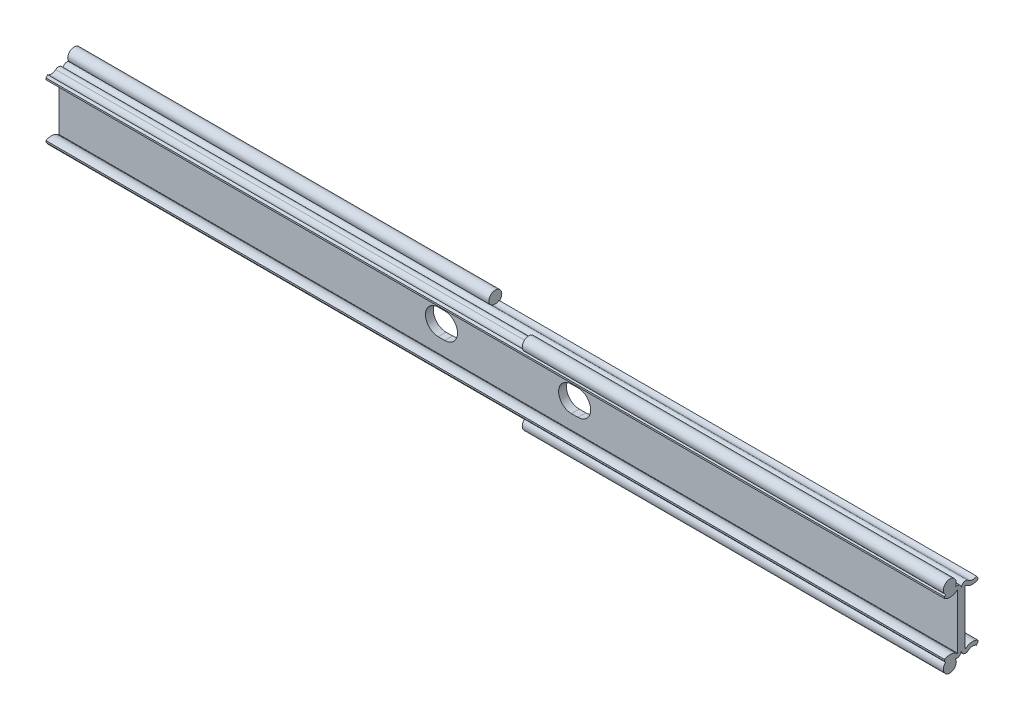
ISO-10303-21;
HEADER;
FILE_DESCRIPTION(('STEP AP214'),'2;1');
FILE_NAME('part.step','',(''),(''),'','','');
FILE_SCHEMA(('AUTOMOTIVE_DESIGN { 1 0 10303 214 1 1 1 1 }'));
ENDSEC;
DATA;
#1=APPLICATION_CONTEXT('core data for automotive mechanical design processes');
#2=APPLICATION_PROTOCOL_DEFINITION('international standard','automotive_design',2000,#1);
#3=PRODUCT_CONTEXT('',#1,'mechanical');
#4=PRODUCT('Part','Part','',(#3));
#5=PRODUCT_RELATED_PRODUCT_CATEGORY('part','',(#4));
#6=PRODUCT_DEFINITION_FORMATION('','',#4);
#7=PRODUCT_DEFINITION_CONTEXT('part definition',#1,'design');
#8=PRODUCT_DEFINITION('design','',#6,#7);
#9=PRODUCT_DEFINITION_SHAPE('','',#8);
#10=(LENGTH_UNIT() NAMED_UNIT(*) SI_UNIT(.MILLI.,.METRE.));
#11=(NAMED_UNIT(*) PLANE_ANGLE_UNIT() SI_UNIT($,.RADIAN.));
#12=(NAMED_UNIT(*) SI_UNIT($,.STERADIAN.) SOLID_ANGLE_UNIT());
#13=UNCERTAINTY_MEASURE_WITH_UNIT(LENGTH_MEASURE(1.E-05),#10,'distance_accuracy_value','');
#14=(GEOMETRIC_REPRESENTATION_CONTEXT(3) GLOBAL_UNCERTAINTY_ASSIGNED_CONTEXT((#13)) GLOBAL_UNIT_ASSIGNED_CONTEXT((#10,
#11,#12)) REPRESENTATION_CONTEXT('',''));
#15=CARTESIAN_POINT('',(0.,0.,0.));
#16=DIRECTION('',(0.,0.,1.));
#17=DIRECTION('',(1.,0.,0.));
#18=AXIS2_PLACEMENT_3D('',#15,#16,#17);
#19=CARTESIAN_POINT('',(-177.8,13.9149993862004,4.44999974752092));
#20=DIRECTION('',(1.,0.,0.));
#21=DIRECTION('',(0.,0.,-1.));
#22=AXIS2_PLACEMENT_3D('',#19,#20,#21);
#23=CYLINDRICAL_SURFACE('',#22,2.54999999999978);
#24=CARTESIAN_POINT('',(11.15,13.9149993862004,4.44999974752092));
#25=DIRECTION('',(1.,0.,0.));
#26=DIRECTION('',(0.,0.,-1.));
#27=AXIS2_PLACEMENT_3D('',#24,#25,#26);
#28=CIRCLE('',#27,2.54999999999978);
#29=CARTESIAN_POINT('',(11.15,12.0059660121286,2.75941062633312));
#30=VERTEX_POINT('',#29);
#31=CARTESIAN_POINT('',(11.15,11.8784793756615,5.98462877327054));
#32=VERTEX_POINT('',#31);
#33=EDGE_CURVE('E323',#30,#32,#28,.F.);
#34=ORIENTED_EDGE('',*,*,#33,.F.);
#35=DIRECTION('',(1.,0.,0.));
#36=VECTOR('',#35,1.);
#37=CARTESIAN_POINT('',(-177.8,12.0059660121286,2.75941062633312));
#38=LINE('',#37,#36);
#39=CARTESIAN_POINT('',(-177.8,12.0059660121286,2.75941062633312));
#40=VERTEX_POINT('',#39);
#41=EDGE_CURVE('E548',#40,#30,#38,.T.);
#42=ORIENTED_EDGE('',*,*,#41,.F.);
#43=CARTESIAN_POINT('',(-177.8,13.9149993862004,4.44999974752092));
#44=DIRECTION('',(1.,0.,0.));
#45=DIRECTION('',(0.,0.,1.));
#46=AXIS2_PLACEMENT_3D('',#43,#44,#45);
#47=CIRCLE('',#46,2.54999999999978);
#48=CARTESIAN_POINT('',(-177.8,11.8784793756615,5.98462877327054));
#49=VERTEX_POINT('',#48);
#50=EDGE_CURVE('E504',#49,#40,#47,.T.);
#51=ORIENTED_EDGE('',*,*,#50,.F.);
#52=DIRECTION('',(1.,0.,0.));
#53=VECTOR('',#52,1.);
#54=CARTESIAN_POINT('',(-177.8,11.8784793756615,5.98462877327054));
#55=LINE('',#54,#53);
#56=EDGE_CURVE('E551',#49,#32,#55,.T.);
#57=ORIENTED_EDGE('',*,*,#56,.T.);
#58=EDGE_LOOP('',(#34,#42,#51,#57));
#59=FACE_BOUND('',#58,.T.);
#60=ADVANCED_FACE('F14',(#59),#23,.F.);
#61=CARTESIAN_POINT('',(-177.8,13.9149993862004,-4.44999974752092));
#62=DIRECTION('',(1.,0.,0.));
#63=DIRECTION('',(0.,0.,-1.));
#64=AXIS2_PLACEMENT_3D('',#61,#62,#63);
#65=CYLINDRICAL_SURFACE('',#64,2.54999999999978);
#66=CARTESIAN_POINT('',(-11.15,13.9149993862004,-4.44999974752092));
#67=DIRECTION('',(-1.,0.,0.));
#68=DIRECTION('',(0.,0.,1.));
#69=AXIS2_PLACEMENT_3D('',#66,#67,#68);
#70=CIRCLE('',#69,2.54999999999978);
#71=CARTESIAN_POINT('',(-11.15,12.0059660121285,-2.75941062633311));
#72=VERTEX_POINT('',#71);
#73=CARTESIAN_POINT('',(-11.15,11.8784793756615,-5.98462877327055));
#74=VERTEX_POINT('',#73);
#75=EDGE_CURVE('E357',#72,#74,#70,.F.);
#76=ORIENTED_EDGE('',*,*,#75,.F.);
#77=DIRECTION('',(1.,0.,0.));
#78=VECTOR('',#77,1.);
#79=CARTESIAN_POINT('',(-177.8,12.0059660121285,-2.75941062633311));
#80=LINE('',#79,#78);
#81=CARTESIAN_POINT('',(177.8,12.0059660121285,-2.75941062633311));
#82=VERTEX_POINT('',#81);
#83=EDGE_CURVE('E543',#72,#82,#80,.T.);
#84=ORIENTED_EDGE('',*,*,#83,.T.);
#85=CARTESIAN_POINT('',(177.8,13.9149993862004,-4.44999974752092));
#86=DIRECTION('',(1.,0.,0.));
#87=DIRECTION('',(0.,0.,-1.));
#88=AXIS2_PLACEMENT_3D('',#85,#86,#87);
#89=CIRCLE('',#88,2.54999999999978);
#90=CARTESIAN_POINT('',(177.8,11.8784793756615,-5.98462877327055));
#91=VERTEX_POINT('',#90);
#92=EDGE_CURVE('E457',#82,#91,#89,.T.);
#93=ORIENTED_EDGE('',*,*,#92,.T.);
#94=DIRECTION('',(1.,0.,0.));
#95=VECTOR('',#94,1.);
#96=CARTESIAN_POINT('',(-177.8,11.8784793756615,-5.98462877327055));
#97=LINE('',#96,#95);
#98=EDGE_CURVE('E541',#74,#91,#97,.T.);
#99=ORIENTED_EDGE('',*,*,#98,.F.);
#100=EDGE_LOOP('',(#76,#84,#93,#99));
#101=FACE_BOUND('',#100,.T.);
#102=ADVANCED_FACE('F682',(#101),#65,.F.);
#103=CARTESIAN_POINT('',(-177.8,-13.9149993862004,-4.44999974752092));
#104=DIRECTION('',(1.,0.,0.));
#105=DIRECTION('',(0.,0.,-1.));
#106=AXIS2_PLACEMENT_3D('',#103,#104,#105);
#107=CYLINDRICAL_SURFACE('',#106,4.09999984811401);
#108=CARTESIAN_POINT('',(177.8,-13.9149993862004,-4.44999974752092));
#109=DIRECTION('',(-1.,0.,0.));
#110=DIRECTION('',(0.,0.,-1.));
#111=AXIS2_PLACEMENT_3D('',#108,#109,#110);
#112=CIRCLE('',#111,4.09999984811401);
#113=CARTESIAN_POINT('',(177.8,-10.8444021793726,-1.73312073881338));
#114=VERTEX_POINT('',#113);
#115=CARTESIAN_POINT('',(177.8,-10.4239395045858,-6.59999966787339));
#116=VERTEX_POINT('',#115);
#117=EDGE_CURVE('E423',#114,#116,#112,.T.);
#118=ORIENTED_EDGE('',*,*,#117,.T.);
#119=DIRECTION('',(1.,0.,0.));
#120=VECTOR('',#119,1.);
#121=CARTESIAN_POINT('',(-177.8,-10.4239395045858,-6.59999966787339));
#122=LINE('',#121,#120);
#123=CARTESIAN_POINT('',(-177.8,-10.4239395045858,-6.59999966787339));
#124=VERTEX_POINT('',#123);
#125=EDGE_CURVE('E591',#124,#116,#122,.T.);
#126=ORIENTED_EDGE('',*,*,#125,.F.);
#127=CARTESIAN_POINT('',(-177.8,-13.9149993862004,-4.44999974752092));
#128=DIRECTION('',(-1.,0.,0.));
#129=DIRECTION('',(0.,0.,-1.));
#130=AXIS2_PLACEMENT_3D('',#127,#128,#129);
#131=CIRCLE('',#130,4.09999984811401);
#132=CARTESIAN_POINT('',(-177.8,-10.8444021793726,-1.73312073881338));
#133=VERTEX_POINT('',#132);
#134=EDGE_CURVE('E472',#133,#124,#131,.T.);
#135=ORIENTED_EDGE('',*,*,#134,.F.);
#136=DIRECTION('',(1.,0.,0.));
#137=VECTOR('',#136,1.);
#138=CARTESIAN_POINT('',(-177.8,-10.8444021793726,-1.73312073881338));
#139=LINE('',#138,#137);
#140=EDGE_CURVE('E523',#133,#114,#139,.T.);
#141=ORIENTED_EDGE('',*,*,#140,.T.);
#142=EDGE_LOOP('',(#118,#126,#135,#141));
#143=FACE_BOUND('',#142,.T.);
#144=ADVANCED_FACE('F16',(#143),#107,.T.);
#145=CARTESIAN_POINT('',(-177.8,-11.0618535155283,-6.59999966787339));
#146=DIRECTION('',(0.,0.,1.));
#147=DIRECTION('',(1.,0.,0.));
#148=AXIS2_PLACEMENT_3D('',#145,#146,#147);
#149=PLANE('',#148);
#150=DIRECTION('',(0.,-1.,0.));
#151=VECTOR('',#150,1.);
#152=CARTESIAN_POINT('',(177.8,-11.0618535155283,-6.59999966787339));
#153=LINE('',#152,#151);
#154=CARTESIAN_POINT('',(177.8,-11.0618535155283,-6.59999966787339));
#155=VERTEX_POINT('',#154);
#156=EDGE_CURVE('E426',#116,#155,#153,.T.);
#157=ORIENTED_EDGE('',*,*,#156,.T.);
#158=DIRECTION('',(1.,0.,0.));
#159=VECTOR('',#158,1.);
#160=CARTESIAN_POINT('',(-177.8,-11.0618535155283,-6.59999966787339));
#161=LINE('',#160,#159);
#162=CARTESIAN_POINT('',(-177.8,-11.0618535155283,-6.59999966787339));
#163=VERTEX_POINT('',#162);
#164=EDGE_CURVE('E588',#163,#155,#161,.T.);
#165=ORIENTED_EDGE('',*,*,#164,.F.);
#166=DIRECTION('',(0.,-1.,0.));
#167=VECTOR('',#166,1.);
#168=CARTESIAN_POINT('',(-177.8,-11.0618535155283,-6.59999966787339));
#169=LINE('',#168,#167);
#170=EDGE_CURVE('E475',#124,#163,#169,.T.);
#171=ORIENTED_EDGE('',*,*,#170,.F.);
#172=ORIENTED_EDGE('',*,*,#125,.T.);
#173=EDGE_LOOP('',(#157,#165,#171,#172));
#174=FACE_BOUND('',#173,.T.);
#175=ADVANCED_FACE('F727',(#174),#149,.F.);
#176=CARTESIAN_POINT('',(-177.8,-11.8784793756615,-5.98462877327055));
#177=DIRECTION('',(0.,0.601814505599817,0.79863590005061));
#178=DIRECTION('',(0.,0.79863590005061,-0.601814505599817));
#179=AXIS2_PLACEMENT_3D('',#176,#177,#178);
#180=PLANE('',#179);
#181=DIRECTION('',(0.,0.79863590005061,-0.601814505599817));
#182=VECTOR('',#181,1.);
#183=CARTESIAN_POINT('',(-11.15,-11.8784793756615,-5.98462877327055));
#184=LINE('',#183,#182);
#185=CARTESIAN_POINT('',(-11.15,-11.8784793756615,-5.98462877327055));
#186=VERTEX_POINT('',#185);
#187=CARTESIAN_POINT('',(-11.15,-11.6159967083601,-6.18242338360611));
#188=VERTEX_POINT('',#187);
#189=EDGE_CURVE('E343',#186,#188,#184,.T.);
#190=ORIENTED_EDGE('',*,*,#189,.T.);
#191=DIRECTION('',(-1.,0.,0.));
#192=VECTOR('',#191,1.);
#193=CARTESIAN_POINT('',(-11.15,-11.6159967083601,-6.18242338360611));
#194=LINE('',#193,#192);
#195=CARTESIAN_POINT('',(-177.8,-11.6159967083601,-6.18242338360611));
#196=VERTEX_POINT('',#195);
#197=EDGE_CURVE('E337',#188,#196,#194,.T.);
#198=ORIENTED_EDGE('',*,*,#197,.T.);
#199=DIRECTION('',(0.,-0.79863590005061,0.601814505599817));
#200=VECTOR('',#199,1.);
#201=CARTESIAN_POINT('',(-177.8,-11.8784793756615,-5.98462877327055));
#202=LINE('',#201,#200);
#203=EDGE_CURVE('E477',#163,#196,#202,.T.);
#204=ORIENTED_EDGE('',*,*,#203,.F.);
#205=ORIENTED_EDGE('',*,*,#164,.T.);
#206=DIRECTION('',(0.,-0.79863590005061,0.601814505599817));
#207=VECTOR('',#206,1.);
#208=CARTESIAN_POINT('',(177.8,-11.8784793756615,-5.98462877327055));
#209=LINE('',#208,#207);
#210=CARTESIAN_POINT('',(177.8,-11.8784793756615,-5.98462877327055));
#211=VERTEX_POINT('',#210);
#212=EDGE_CURVE('E428',#155,#211,#209,.T.);
#213=ORIENTED_EDGE('',*,*,#212,.T.);
#214=DIRECTION('',(1.,0.,0.));
#215=VECTOR('',#214,1.);
#216=CARTESIAN_POINT('',(-177.8,-11.8784793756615,-5.98462877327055));
#217=LINE('',#216,#215);
#218=EDGE_CURVE('E586',#186,#211,#217,.T.);
#219=ORIENTED_EDGE('',*,*,#218,.F.);
#220=EDGE_LOOP('',(#190,#198,#204,#205,#213,#219));
#221=FACE_BOUND('',#220,.T.);
#222=ADVANCED_FACE('F724',(#221),#180,.F.);
#223=CARTESIAN_POINT('',(-177.8,-13.9149993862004,-4.44999974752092));
#224=DIRECTION('',(1.,0.,0.));
#225=DIRECTION('',(0.,0.,-1.));
#226=AXIS2_PLACEMENT_3D('',#223,#224,#225);
#227=CYLINDRICAL_SURFACE('',#226,2.54999999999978);
#228=DIRECTION('',(1.,0.,0.));
#229=VECTOR('',#228,1.);
#230=CARTESIAN_POINT('',(-177.8,-12.0059660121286,-2.75941062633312));
#231=LINE('',#230,#229);
#232=CARTESIAN_POINT('',(-11.15,-12.0059660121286,-2.75941062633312));
#233=VERTEX_POINT('',#232);
#234=CARTESIAN_POINT('',(177.8,-12.0059660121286,-2.75941062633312));
#235=VERTEX_POINT('',#234);
#236=EDGE_CURVE('E584',#233,#235,#231,.T.);
#237=ORIENTED_EDGE('',*,*,#236,.F.);
#238=CARTESIAN_POINT('',(-11.15,-13.9149993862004,-4.44999974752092));
#239=DIRECTION('',(1.,0.,0.));
#240=DIRECTION('',(0.,0.,-1.));
#241=AXIS2_PLACEMENT_3D('',#238,#239,#240);
#242=CIRCLE('',#241,2.54999999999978);
#243=EDGE_CURVE('E340',#233,#186,#242,.F.);
#244=ORIENTED_EDGE('',*,*,#243,.T.);
#245=ORIENTED_EDGE('',*,*,#218,.T.);
#246=CARTESIAN_POINT('',(177.8,-13.9149993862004,-4.44999974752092));
#247=DIRECTION('',(1.,0.,0.));
#248=DIRECTION('',(0.,0.,1.));
#249=AXIS2_PLACEMENT_3D('',#246,#247,#248);
#250=CIRCLE('',#249,2.54999999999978);
#251=EDGE_CURVE('E431',#211,#235,#250,.T.);
#252=ORIENTED_EDGE('',*,*,#251,.T.);
#253=EDGE_LOOP('',(#237,#244,#245,#252));
#254=FACE_BOUND('',#253,.T.);
#255=ADVANCED_FACE('F720',(#254),#227,.F.);
#256=CARTESIAN_POINT('',(-177.8,-10.7622235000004,-1.65999984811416));
#257=DIRECTION('',(1.,0.,0.));
#258=DIRECTION('',(0.,0.,-1.));
#259=AXIS2_PLACEMENT_3D('',#256,#257,#258);
#260=CYLINDRICAL_SURFACE('',#259,1.65999984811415);
#261=CARTESIAN_POINT('',(-177.8,-10.7622235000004,-1.65999984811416));
#262=DIRECTION('',(-1.,0.,0.));
#263=DIRECTION('',(0.,0.,-1.));
#264=AXIS2_PLACEMENT_3D('',#261,#262,#263);
#265=CIRCLE('',#264,1.65999984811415);
#266=CARTESIAN_POINT('',(-177.8,-12.2669165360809,-2.36106929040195));
#267=VERTEX_POINT('',#266);
#268=CARTESIAN_POINT('',(-177.8,-10.7622235,0.));
#269=VERTEX_POINT('',#268);
#270=EDGE_CURVE('E480',#267,#269,#265,.T.);
#271=ORIENTED_EDGE('',*,*,#270,.F.);
#272=DIRECTION('',(-1.,0.,0.));
#273=VECTOR('',#272,1.);
#274=CARTESIAN_POINT('',(-94.475,-12.2669165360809,-2.36106929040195));
#275=LINE('',#274,#273);
#276=CARTESIAN_POINT('',(-11.15,-12.2669165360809,-2.36106929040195));
#277=VERTEX_POINT('',#276);
#278=EDGE_CURVE('E333',#267,#277,#275,.F.);
#279=ORIENTED_EDGE('',*,*,#278,.T.);
#280=CARTESIAN_POINT('',(-11.15,-10.7622235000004,-1.65999984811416));
#281=DIRECTION('',(1.,0.,0.));
#282=DIRECTION('',(0.,0.,-1.));
#283=AXIS2_PLACEMENT_3D('',#280,#281,#282);
#284=CIRCLE('',#283,1.65999984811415);
#285=EDGE_CURVE('E596',#277,#233,#284,.T.);
#286=ORIENTED_EDGE('',*,*,#285,.T.);
#287=ORIENTED_EDGE('',*,*,#236,.T.);
#288=CARTESIAN_POINT('',(177.8,-10.7622235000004,-1.65999984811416));
#289=DIRECTION('',(-1.,0.,0.));
#290=DIRECTION('',(0.,0.,-1.));
#291=AXIS2_PLACEMENT_3D('',#288,#289,#290);
#292=CIRCLE('',#291,1.65999984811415);
#293=CARTESIAN_POINT('',(177.8,-10.7622235,0.));
#294=VERTEX_POINT('',#293);
#295=EDGE_CURVE('E434',#235,#294,#292,.T.);
#296=ORIENTED_EDGE('',*,*,#295,.T.);
#297=DIRECTION('',(1.,0.,0.));
#298=VECTOR('',#297,1.);
#299=CARTESIAN_POINT('',(-177.8,-10.7622235,0.));
#300=LINE('',#299,#298);
#301=EDGE_CURVE('E581',#269,#294,#300,.T.);
#302=ORIENTED_EDGE('',*,*,#301,.F.);
#303=EDGE_LOOP('',(#271,#279,#286,#287,#296,#302));
#304=FACE_BOUND('',#303,.T.);
#305=ADVANCED_FACE('F717',(#304),#260,.T.);
#306=CARTESIAN_POINT('',(-177.8,-10.7622235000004,1.65999984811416));
#307=DIRECTION('',(1.,0.,0.));
#308=DIRECTION('',(0.,0.,-1.));
#309=AXIS2_PLACEMENT_3D('',#306,#307,#308);
#310=CYLINDRICAL_SURFACE('',#309,1.65999984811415);
#311=CARTESIAN_POINT('',(177.8,-10.7622235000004,1.65999984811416));
#312=DIRECTION('',(-1.,0.,0.));
#313=DIRECTION('',(0.,0.,1.));
#314=AXIS2_PLACEMENT_3D('',#311,#312,#313);
#315=CIRCLE('',#314,1.65999984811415);
#316=CARTESIAN_POINT('',(177.8,-12.2669165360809,2.36106929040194));
#317=VERTEX_POINT('',#316);
#318=EDGE_CURVE('E292',#294,#317,#315,.T.);
#319=ORIENTED_EDGE('',*,*,#318,.T.);
#320=DIRECTION('',(1.,0.,0.));
#321=VECTOR('',#320,1.);
#322=CARTESIAN_POINT('',(94.475,-12.2669165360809,2.36106929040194));
#323=LINE('',#322,#321);
#324=CARTESIAN_POINT('',(11.15,-12.2669165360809,2.36106929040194));
#325=VERTEX_POINT('',#324);
#326=EDGE_CURVE('E29',#317,#325,#323,.F.);
#327=ORIENTED_EDGE('',*,*,#326,.T.);
#328=CARTESIAN_POINT('',(11.15,-10.7622235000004,1.65999984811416));
#329=DIRECTION('',(-1.,0.,0.));
#330=DIRECTION('',(0.,0.,1.));
#331=AXIS2_PLACEMENT_3D('',#328,#329,#330);
#332=CIRCLE('',#331,1.65999984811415);
#333=CARTESIAN_POINT('',(11.15,-12.0059660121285,2.75941062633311));
#334=VERTEX_POINT('',#333);
#335=EDGE_CURVE('E33',#325,#334,#332,.T.);
#336=ORIENTED_EDGE('',*,*,#335,.T.);
#337=DIRECTION('',(1.,0.,0.));
#338=VECTOR('',#337,1.);
#339=CARTESIAN_POINT('',(-177.8,-12.0059660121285,2.75941062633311));
#340=LINE('',#339,#338);
#341=CARTESIAN_POINT('',(-177.8,-12.0059660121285,2.75941062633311));
#342=VERTEX_POINT('',#341);
#343=EDGE_CURVE('E579',#342,#334,#340,.T.);
#344=ORIENTED_EDGE('',*,*,#343,.F.);
#345=CARTESIAN_POINT('',(-177.8,-10.7622235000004,1.65999984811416));
#346=DIRECTION('',(-1.,0.,0.));
#347=DIRECTION('',(0.,0.,1.));
#348=AXIS2_PLACEMENT_3D('',#345,#346,#347);
#349=CIRCLE('',#348,1.65999984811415);
#350=EDGE_CURVE('E482',#269,#342,#349,.T.);
#351=ORIENTED_EDGE('',*,*,#350,.F.);
#352=ORIENTED_EDGE('',*,*,#301,.T.);
#353=EDGE_LOOP('',(#319,#327,#336,#344,#351,#352));
#354=FACE_BOUND('',#353,.T.);
#355=ADVANCED_FACE('F714',(#354),#310,.T.);
#356=CARTESIAN_POINT('',(-177.8,-13.9149993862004,4.44999974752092));
#357=DIRECTION('',(1.,0.,0.));
#358=DIRECTION('',(0.,0.,-1.));
#359=AXIS2_PLACEMENT_3D('',#356,#357,#358);
#360=CYLINDRICAL_SURFACE('',#359,2.54999999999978);
#361=ORIENTED_EDGE('',*,*,#343,.T.);
#362=CARTESIAN_POINT('',(11.15,-13.9149993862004,4.44999974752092));
#363=DIRECTION('',(-1.,0.,0.));
#364=DIRECTION('',(0.,0.,1.));
#365=AXIS2_PLACEMENT_3D('',#362,#363,#364);
#366=CIRCLE('',#365,2.54999999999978);
#367=CARTESIAN_POINT('',(11.15,-11.8784793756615,5.98462877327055));
#368=VERTEX_POINT('',#367);
#369=EDGE_CURVE('E309',#334,#368,#366,.F.);
#370=ORIENTED_EDGE('',*,*,#369,.T.);
#371=DIRECTION('',(1.,0.,0.));
#372=VECTOR('',#371,1.);
#373=CARTESIAN_POINT('',(-177.8,-11.8784793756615,5.98462877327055));
#374=LINE('',#373,#372);
#375=CARTESIAN_POINT('',(-177.8,-11.8784793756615,5.98462877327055));
#376=VERTEX_POINT('',#375);
#377=EDGE_CURVE('E577',#376,#368,#374,.T.);
#378=ORIENTED_EDGE('',*,*,#377,.F.);
#379=CARTESIAN_POINT('',(-177.8,-13.9149993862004,4.44999974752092));
#380=DIRECTION('',(1.,0.,0.));
#381=DIRECTION('',(0.,0.,-1.));
#382=AXIS2_PLACEMENT_3D('',#379,#380,#381);
#383=CIRCLE('',#382,2.54999999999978);
#384=EDGE_CURVE('E484',#342,#376,#383,.T.);
#385=ORIENTED_EDGE('',*,*,#384,.F.);
#386=EDGE_LOOP('',(#361,#370,#378,#385));
#387=FACE_BOUND('',#386,.T.);
#388=ADVANCED_FACE('F667',(#387),#360,.F.);
#389=CARTESIAN_POINT('',(-177.8,-11.8784793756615,5.98462877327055));
#390=DIRECTION('',(0.,0.601814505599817,-0.79863590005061));
#391=DIRECTION('',(0.,-0.79863590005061,-0.601814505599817));
#392=AXIS2_PLACEMENT_3D('',#389,#390,#391);
#393=PLANE('',#392);
#394=DIRECTION('',(0.,0.79863590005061,0.601814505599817));
#395=VECTOR('',#394,1.);
#396=CARTESIAN_POINT('',(11.15,-11.8784793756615,5.98462877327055));
#397=LINE('',#396,#395);
#398=CARTESIAN_POINT('',(11.15,-11.6159967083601,6.18242338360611));
#399=VERTEX_POINT('',#398);
#400=EDGE_CURVE('E9',#368,#399,#397,.T.);
#401=ORIENTED_EDGE('',*,*,#400,.T.);
#402=DIRECTION('',(1.,0.,0.));
#403=VECTOR('',#402,1.);
#404=CARTESIAN_POINT('',(11.15,-11.6159967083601,6.18242338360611));
#405=LINE('',#404,#403);
#406=CARTESIAN_POINT('',(177.8,-11.6159967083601,6.18242338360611));
#407=VERTEX_POINT('',#406);
#408=EDGE_CURVE('E295',#399,#407,#405,.T.);
#409=ORIENTED_EDGE('',*,*,#408,.T.);
#410=DIRECTION('',(0.,0.79863590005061,0.601814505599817));
#411=VECTOR('',#410,1.);
#412=CARTESIAN_POINT('',(177.8,-11.8784793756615,5.98462877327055));
#413=LINE('',#412,#411);
#414=CARTESIAN_POINT('',(177.8,-11.0618535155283,6.59999966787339));
#415=VERTEX_POINT('',#414);
#416=EDGE_CURVE('E281',#407,#415,#413,.T.);
#417=ORIENTED_EDGE('',*,*,#416,.T.);
#418=DIRECTION('',(1.,0.,0.));
#419=VECTOR('',#418,1.);
#420=CARTESIAN_POINT('',(-177.8,-11.0618535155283,6.59999966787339));
#421=LINE('',#420,#419);
#422=CARTESIAN_POINT('',(-177.8,-11.0618535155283,6.59999966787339));
#423=VERTEX_POINT('',#422);
#424=EDGE_CURVE('E575',#423,#415,#421,.T.);
#425=ORIENTED_EDGE('',*,*,#424,.F.);
#426=DIRECTION('',(0.,0.79863590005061,0.601814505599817));
#427=VECTOR('',#426,1.);
#428=CARTESIAN_POINT('',(-177.8,-11.8784793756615,5.98462877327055));
#429=LINE('',#428,#427);
#430=EDGE_CURVE('E486',#376,#423,#429,.T.);
#431=ORIENTED_EDGE('',*,*,#430,.F.);
#432=ORIENTED_EDGE('',*,*,#377,.T.);
#433=EDGE_LOOP('',(#401,#409,#417,#425,#431,#432));
#434=FACE_BOUND('',#433,.T.);
#435=ADVANCED_FACE('F296',(#434),#393,.F.);
#436=CARTESIAN_POINT('',(-177.8,-11.0618535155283,6.59999966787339));
#437=DIRECTION('',(0.,0.,-1.));
#438=DIRECTION('',(-1.,0.,0.));
#439=AXIS2_PLACEMENT_3D('',#436,#437,#438);
#440=PLANE('',#439);
#441=DIRECTION('',(0.,1.,0.));
#442=VECTOR('',#441,1.);
#443=CARTESIAN_POINT('',(177.8,-11.0618535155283,6.59999966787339));
#444=LINE('',#443,#442);
#445=CARTESIAN_POINT('',(177.8,-10.4239395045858,6.59999966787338));
#446=VERTEX_POINT('',#445);
#447=EDGE_CURVE('E288',#415,#446,#444,.T.);
#448=ORIENTED_EDGE('',*,*,#447,.T.);
#449=DIRECTION('',(1.,0.,0.));
#450=VECTOR('',#449,1.);
#451=CARTESIAN_POINT('',(-177.8,-10.4239395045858,6.59999966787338));
#452=LINE('',#451,#450);
#453=CARTESIAN_POINT('',(-177.8,-10.4239395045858,6.59999966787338));
#454=VERTEX_POINT('',#453);
#455=EDGE_CURVE('E572',#454,#446,#452,.T.);
#456=ORIENTED_EDGE('',*,*,#455,.F.);
#457=DIRECTION('',(0.,1.,0.));
#458=VECTOR('',#457,1.);
#459=CARTESIAN_POINT('',(-177.8,-11.0618535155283,6.59999966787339));
#460=LINE('',#459,#458);
#461=EDGE_CURVE('E488',#423,#454,#460,.T.);
#462=ORIENTED_EDGE('',*,*,#461,.F.);
#463=ORIENTED_EDGE('',*,*,#424,.T.);
#464=EDGE_LOOP('',(#448,#456,#462,#463));
#465=FACE_BOUND('',#464,.T.);
#466=ADVANCED_FACE('F661',(#465),#440,.F.);
#467=CARTESIAN_POINT('',(-177.8,-13.9149993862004,4.44999974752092));
#468=DIRECTION('',(1.,0.,0.));
#469=DIRECTION('',(0.,0.,-1.));
#470=AXIS2_PLACEMENT_3D('',#467,#468,#469);
#471=CYLINDRICAL_SURFACE('',#470,4.09999984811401);
#472=CARTESIAN_POINT('',(177.8,-13.9149993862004,4.44999974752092));
#473=DIRECTION('',(-1.,0.,0.));
#474=DIRECTION('',(0.,0.,1.));
#475=AXIS2_PLACEMENT_3D('',#472,#473,#474);
#476=CIRCLE('',#475,4.09999984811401);
#477=CARTESIAN_POINT('',(177.8,-10.8444021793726,1.73312073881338));
#478=VERTEX_POINT('',#477);
#479=EDGE_CURVE('E438',#446,#478,#476,.T.);
#480=ORIENTED_EDGE('',*,*,#479,.T.);
#481=DIRECTION('',(1.,0.,0.));
#482=VECTOR('',#481,1.);
#483=CARTESIAN_POINT('',(-177.8,-10.8444021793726,1.73312073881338));
#484=LINE('',#483,#482);
#485=CARTESIAN_POINT('',(-177.8,-10.8444021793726,1.73312073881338));
#486=VERTEX_POINT('',#485);
#487=EDGE_CURVE('E569',#486,#478,#484,.T.);
#488=ORIENTED_EDGE('',*,*,#487,.F.);
#489=CARTESIAN_POINT('',(-177.8,-13.9149993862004,4.44999974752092));
#490=DIRECTION('',(-1.,0.,0.));
#491=DIRECTION('',(0.,0.,1.));
#492=AXIS2_PLACEMENT_3D('',#489,#490,#491);
#493=CIRCLE('',#492,4.09999984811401);
#494=EDGE_CURVE('E490',#454,#486,#493,.T.);
#495=ORIENTED_EDGE('',*,*,#494,.F.);
#496=ORIENTED_EDGE('',*,*,#455,.T.);
#497=EDGE_LOOP('',(#480,#488,#495,#496));
#498=FACE_BOUND('',#497,.T.);
#499=ADVANCED_FACE('F657',(#498),#471,.T.);
#500=CARTESIAN_POINT('',(-177.8,-10.7622235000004,1.65999984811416));
#501=DIRECTION('',(1.,0.,0.));
#502=DIRECTION('',(0.,0.,-1.));
#503=AXIS2_PLACEMENT_3D('',#500,#501,#502);
#504=CYLINDRICAL_SURFACE('',#503,0.110000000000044);
#505=CARTESIAN_POINT('',(177.8,-10.7622235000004,1.65999984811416));
#506=DIRECTION('',(1.,0.,0.));
#507=DIRECTION('',(0.,0.,-1.));
#508=AXIS2_PLACEMENT_3D('',#505,#506,#507);
#509=CIRCLE('',#508,0.110000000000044);
#510=CARTESIAN_POINT('',(177.8,-10.7622235,1.5499998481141));
#511=VERTEX_POINT('',#510);
#512=EDGE_CURVE('E440',#478,#511,#509,.T.);
#513=ORIENTED_EDGE('',*,*,#512,.T.);
#514=DIRECTION('',(1.,0.,0.));
#515=VECTOR('',#514,1.);
#516=CARTESIAN_POINT('',(-177.8,-10.7622235,1.5499998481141));
#517=LINE('',#516,#515);
#518=CARTESIAN_POINT('',(-177.8,-10.7622235,1.5499998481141));
#519=VERTEX_POINT('',#518);
#520=EDGE_CURVE('E566',#519,#511,#517,.T.);
#521=ORIENTED_EDGE('',*,*,#520,.F.);
#522=CARTESIAN_POINT('',(-177.8,-10.7622235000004,1.65999984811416));
#523=DIRECTION('',(1.,0.,0.));
#524=DIRECTION('',(0.,0.,-1.));
#525=AXIS2_PLACEMENT_3D('',#522,#523,#524);
#526=CIRCLE('',#525,0.110000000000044);
#527=EDGE_CURVE('E492',#486,#519,#526,.T.);
#528=ORIENTED_EDGE('',*,*,#527,.F.);
#529=ORIENTED_EDGE('',*,*,#487,.T.);
#530=EDGE_LOOP('',(#513,#521,#528,#529));
#531=FACE_BOUND('',#530,.T.);
#532=ADVANCED_FACE('F652',(#531),#504,.F.);
#533=CARTESIAN_POINT('',(-177.8,10.7622235,1.5499998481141));
#534=DIRECTION('',(0.,0.,-1.));
#535=DIRECTION('',(-1.,0.,0.));
#536=AXIS2_PLACEMENT_3D('',#533,#534,#535);
#537=PLANE('',#536);
#538=DIRECTION('',(1.,0.,0.));
#539=VECTOR('',#538,1.);
#540=CARTESIAN_POINT('',(27.65,-5.05,1.5499998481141));
#541=LINE('',#540,#539);
#542=CARTESIAN_POINT('',(25.05,-5.05,1.5499998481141));
#543=VERTEX_POINT('',#542);
#544=CARTESIAN_POINT('',(27.65,-5.05,1.5499998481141));
#545=VERTEX_POINT('',#544);
#546=EDGE_CURVE('E371',#543,#545,#541,.T.);
#547=ORIENTED_EDGE('',*,*,#546,.F.);
#548=CARTESIAN_POINT('',(25.05,0.,1.5499998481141));
#549=DIRECTION('',(0.,0.,1.));
#550=DIRECTION('',(1.,0.,0.));
#551=AXIS2_PLACEMENT_3D('',#548,#549,#550);
#552=CIRCLE('',#551,5.05);
#553=CARTESIAN_POINT('',(25.05,5.05,1.5499998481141));
#554=VERTEX_POINT('',#553);
#555=EDGE_CURVE('E369',#554,#543,#552,.T.);
#556=ORIENTED_EDGE('',*,*,#555,.F.);
#557=DIRECTION('',(-1.,0.,0.));
#558=VECTOR('',#557,1.);
#559=CARTESIAN_POINT('',(25.05,5.05,1.5499998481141));
#560=LINE('',#559,#558);
#561=CARTESIAN_POINT('',(27.65,5.05,1.5499998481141));
#562=VERTEX_POINT('',#561);
#563=EDGE_CURVE('E377',#562,#554,#560,.T.);
#564=ORIENTED_EDGE('',*,*,#563,.F.);
#565=CARTESIAN_POINT('',(27.65,0.,1.5499998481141));
#566=DIRECTION('',(0.,0.,1.));
#567=DIRECTION('',(1.,0.,0.));
#568=AXIS2_PLACEMENT_3D('',#565,#566,#567);
#569=CIRCLE('',#568,5.05);
#570=EDGE_CURVE('E374',#545,#562,#569,.T.);
#571=ORIENTED_EDGE('',*,*,#570,.F.);
#572=EDGE_LOOP('',(#547,#556,#564,#571));
#573=FACE_BOUND('',#572,.T.);
#574=DIRECTION('',(1.,0.,0.));
#575=VECTOR('',#574,1.);
#576=CARTESIAN_POINT('',(-27.65,-5.05,1.5499998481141));
#577=LINE('',#576,#575);
#578=CARTESIAN_POINT('',(-27.65,-5.05,1.5499998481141));
#579=VERTEX_POINT('',#578);
#580=CARTESIAN_POINT('',(-25.05,-5.05,1.5499998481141));
#581=VERTEX_POINT('',#580);
#582=EDGE_CURVE('E402',#579,#581,#577,.T.);
#583=ORIENTED_EDGE('',*,*,#582,.F.);
#584=CARTESIAN_POINT('',(-27.65,0.,1.5499998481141));
#585=DIRECTION('',(0.,0.,1.));
#586=DIRECTION('',(-1.,0.,0.));
#587=AXIS2_PLACEMENT_3D('',#584,#585,#586);
#588=CIRCLE('',#587,5.05);
#589=CARTESIAN_POINT('',(-27.65,5.05,1.5499998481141));
#590=VERTEX_POINT('',#589);
#591=EDGE_CURVE('E400',#590,#579,#588,.T.);
#592=ORIENTED_EDGE('',*,*,#591,.F.);
#593=DIRECTION('',(-1.,0.,0.));
#594=VECTOR('',#593,1.);
#595=CARTESIAN_POINT('',(-25.05,5.05,1.5499998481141));
#596=LINE('',#595,#594);
#597=CARTESIAN_POINT('',(-25.05,5.05,1.5499998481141));
#598=VERTEX_POINT('',#597);
#599=EDGE_CURVE('E408',#598,#590,#596,.T.);
#600=ORIENTED_EDGE('',*,*,#599,.F.);
#601=CARTESIAN_POINT('',(-25.05,0.,1.5499998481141));
#602=DIRECTION('',(0.,0.,1.));
#603=DIRECTION('',(-1.,0.,0.));
#604=AXIS2_PLACEMENT_3D('',#601,#602,#603);
#605=CIRCLE('',#604,5.05);
#606=EDGE_CURVE('E405',#581,#598,#605,.T.);
#607=ORIENTED_EDGE('',*,*,#606,.F.);
#608=EDGE_LOOP('',(#583,#592,#600,#607));
#609=FACE_BOUND('',#608,.T.);
#610=DIRECTION('',(0.,1.,0.));
#611=VECTOR('',#610,1.);
#612=CARTESIAN_POINT('',(177.8,10.7622235,1.5499998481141));
#613=LINE('',#612,#611);
#614=CARTESIAN_POINT('',(177.8,10.7622235,1.54999984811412));
#615=VERTEX_POINT('',#614);
#616=EDGE_CURVE('E442',#511,#615,#613,.T.);
#617=ORIENTED_EDGE('',*,*,#616,.T.);
#618=DIRECTION('',(1.,0.,0.));
#619=VECTOR('',#618,1.);
#620=CARTESIAN_POINT('',(-177.8,10.7622235,1.54999984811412));
#621=LINE('',#620,#619);
#622=CARTESIAN_POINT('',(-177.8,10.7622235,1.54999984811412));
#623=VERTEX_POINT('',#622);
#624=EDGE_CURVE('E563',#623,#615,#621,.T.);
#625=ORIENTED_EDGE('',*,*,#624,.F.);
#626=DIRECTION('',(0.,1.,0.));
#627=VECTOR('',#626,1.);
#628=CARTESIAN_POINT('',(-177.8,10.7622235,1.5499998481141));
#629=LINE('',#628,#627);
#630=EDGE_CURVE('E494',#519,#623,#629,.T.);
#631=ORIENTED_EDGE('',*,*,#630,.F.);
#632=ORIENTED_EDGE('',*,*,#520,.T.);
#633=EDGE_LOOP('',(#617,#625,#631,#632));
#634=FACE_BOUND('',#633,.T.);
#635=ADVANCED_FACE('F648',(#573,#609,#634),#537,.F.);
#636=CARTESIAN_POINT('',(-177.8,10.7622235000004,1.65999984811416));
#637=DIRECTION('',(1.,0.,0.));
#638=DIRECTION('',(0.,0.,-1.));
#639=AXIS2_PLACEMENT_3D('',#636,#637,#638);
#640=CYLINDRICAL_SURFACE('',#639,0.110000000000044);
#641=CARTESIAN_POINT('',(177.8,10.7622235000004,1.65999984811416));
#642=DIRECTION('',(1.,0.,0.));
#643=DIRECTION('',(0.,0.,1.));
#644=AXIS2_PLACEMENT_3D('',#641,#642,#643);
#645=CIRCLE('',#644,0.110000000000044);
#646=CARTESIAN_POINT('',(177.8,10.8444021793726,1.73312073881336));
#647=VERTEX_POINT('',#646);
#648=EDGE_CURVE('E444',#615,#647,#645,.T.);
#649=ORIENTED_EDGE('',*,*,#648,.T.);
#650=DIRECTION('',(1.,0.,0.));
#651=VECTOR('',#650,1.);
#652=CARTESIAN_POINT('',(-177.8,10.8444021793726,1.73312073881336));
#653=LINE('',#652,#651);
#654=CARTESIAN_POINT('',(-177.8,10.8444021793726,1.73312073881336));
#655=VERTEX_POINT('',#654);
#656=EDGE_CURVE('E560',#655,#647,#653,.T.);
#657=ORIENTED_EDGE('',*,*,#656,.F.);
#658=CARTESIAN_POINT('',(-177.8,10.7622235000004,1.65999984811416));
#659=DIRECTION('',(1.,0.,0.));
#660=DIRECTION('',(0.,0.,1.));
#661=AXIS2_PLACEMENT_3D('',#658,#659,#660);
#662=CIRCLE('',#661,0.110000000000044);
#663=EDGE_CURVE('E496',#623,#655,#662,.T.);
#664=ORIENTED_EDGE('',*,*,#663,.F.);
#665=ORIENTED_EDGE('',*,*,#624,.T.);
#666=EDGE_LOOP('',(#649,#657,#664,#665));
#667=FACE_BOUND('',#666,.T.);
#668=ADVANCED_FACE('F644',(#667),#640,.F.);
#669=CARTESIAN_POINT('',(-177.8,13.9149993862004,4.44999974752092));
#670=DIRECTION('',(1.,0.,0.));
#671=DIRECTION('',(0.,0.,-1.));
#672=AXIS2_PLACEMENT_3D('',#669,#670,#671);
#673=CYLINDRICAL_SURFACE('',#672,4.09999984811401);
#674=CARTESIAN_POINT('',(177.8,13.9149993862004,4.44999974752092));
#675=DIRECTION('',(-1.,0.,0.));
#676=DIRECTION('',(0.,0.,-1.));
#677=AXIS2_PLACEMENT_3D('',#674,#675,#676);
#678=CIRCLE('',#677,4.09999984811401);
#679=CARTESIAN_POINT('',(177.8,10.4239395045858,6.59999966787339));
#680=VERTEX_POINT('',#679);
#681=EDGE_CURVE('E446',#647,#680,#678,.T.);
#682=ORIENTED_EDGE('',*,*,#681,.T.);
#683=DIRECTION('',(1.,0.,0.));
#684=VECTOR('',#683,1.);
#685=CARTESIAN_POINT('',(-177.8,10.4239395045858,6.59999966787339));
#686=LINE('',#685,#684);
#687=CARTESIAN_POINT('',(-177.8,10.4239395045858,6.59999966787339));
#688=VERTEX_POINT('',#687);
#689=EDGE_CURVE('E557',#688,#680,#686,.T.);
#690=ORIENTED_EDGE('',*,*,#689,.F.);
#691=CARTESIAN_POINT('',(-177.8,13.9149993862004,4.44999974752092));
#692=DIRECTION('',(-1.,0.,0.));
#693=DIRECTION('',(0.,0.,-1.));
#694=AXIS2_PLACEMENT_3D('',#691,#692,#693);
#695=CIRCLE('',#694,4.09999984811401);
#696=EDGE_CURVE('E498',#655,#688,#695,.T.);
#697=ORIENTED_EDGE('',*,*,#696,.F.);
#698=ORIENTED_EDGE('',*,*,#656,.T.);
#699=EDGE_LOOP('',(#682,#690,#697,#698));
#700=FACE_BOUND('',#699,.T.);
#701=ADVANCED_FACE('F639',(#700),#673,.T.);
#702=CARTESIAN_POINT('',(-177.8,11.0618535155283,6.59999966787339));
#703=DIRECTION('',(0.,0.,-1.));
#704=DIRECTION('',(-1.,0.,0.));
#705=AXIS2_PLACEMENT_3D('',#702,#703,#704);
#706=PLANE('',#705);
#707=DIRECTION('',(0.,1.,0.));
#708=VECTOR('',#707,1.);
#709=CARTESIAN_POINT('',(177.8,11.0618535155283,6.59999966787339));
#710=LINE('',#709,#708);
#711=CARTESIAN_POINT('',(177.8,11.0618535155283,6.59999966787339));
#712=VERTEX_POINT('',#711);
#713=EDGE_CURVE('E448',#680,#712,#710,.T.);
#714=ORIENTED_EDGE('',*,*,#713,.T.);
#715=DIRECTION('',(1.,0.,0.));
#716=VECTOR('',#715,1.);
#717=CARTESIAN_POINT('',(-177.8,11.0618535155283,6.59999966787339));
#718=LINE('',#717,#716);
#719=CARTESIAN_POINT('',(-177.8,11.0618535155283,6.59999966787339));
#720=VERTEX_POINT('',#719);
#721=EDGE_CURVE('E554',#720,#712,#718,.T.);
#722=ORIENTED_EDGE('',*,*,#721,.F.);
#723=DIRECTION('',(0.,1.,0.));
#724=VECTOR('',#723,1.);
#725=CARTESIAN_POINT('',(-177.8,11.0618535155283,6.59999966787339));
#726=LINE('',#725,#724);
#727=EDGE_CURVE('E500',#688,#720,#726,.T.);
#728=ORIENTED_EDGE('',*,*,#727,.F.);
#729=ORIENTED_EDGE('',*,*,#689,.T.);
#730=EDGE_LOOP('',(#714,#722,#728,#729));
#731=FACE_BOUND('',#730,.T.);
#732=ADVANCED_FACE('F633',(#731),#706,.F.);
#733=CARTESIAN_POINT('',(-177.8,11.8784793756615,5.98462877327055));
#734=DIRECTION('',(0.,-0.601814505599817,-0.79863590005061));
#735=DIRECTION('',(0.,-0.79863590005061,0.601814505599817));
#736=AXIS2_PLACEMENT_3D('',#733,#734,#735);
#737=PLANE('',#736);
#738=DIRECTION('',(0.,0.79863590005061,-0.601814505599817));
#739=VECTOR('',#738,1.);
#740=CARTESIAN_POINT('',(177.8,11.8784793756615,5.98462877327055));
#741=LINE('',#740,#739);
#742=CARTESIAN_POINT('',(177.8,11.6159967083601,6.18242338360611));
#743=VERTEX_POINT('',#742);
#744=EDGE_CURVE('E450',#712,#743,#741,.T.);
#745=ORIENTED_EDGE('',*,*,#744,.T.);
#746=DIRECTION('',(1.,0.,0.));
#747=VECTOR('',#746,1.);
#748=CARTESIAN_POINT('',(11.15,11.6159967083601,6.18242338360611));
#749=LINE('',#748,#747);
#750=CARTESIAN_POINT('',(11.15,11.6159967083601,6.18242338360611));
#751=VERTEX_POINT('',#750);
#752=EDGE_CURVE('E321',#743,#751,#749,.F.);
#753=ORIENTED_EDGE('',*,*,#752,.T.);
#754=DIRECTION('',(0.,-0.79863590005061,0.601814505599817));
#755=VECTOR('',#754,1.);
#756=CARTESIAN_POINT('',(11.15,11.8784793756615,5.98462877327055));
#757=LINE('',#756,#755);
#758=EDGE_CURVE('E326',#32,#751,#757,.T.);
#759=ORIENTED_EDGE('',*,*,#758,.F.);
#760=ORIENTED_EDGE('',*,*,#56,.F.);
#761=DIRECTION('',(0.,0.79863590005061,-0.601814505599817));
#762=VECTOR('',#761,1.);
#763=CARTESIAN_POINT('',(-177.8,11.8784793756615,5.98462877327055));
#764=LINE('',#763,#762);
#765=EDGE_CURVE('E502',#720,#49,#764,.T.);
#766=ORIENTED_EDGE('',*,*,#765,.F.);
#767=ORIENTED_EDGE('',*,*,#721,.T.);
#768=EDGE_LOOP('',(#745,#753,#759,#760,#766,#767));
#769=FACE_BOUND('',#768,.T.);
#770=ADVANCED_FACE('F629',(#769),#737,.F.);
#771=CARTESIAN_POINT('',(-177.8,10.7622235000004,1.65999984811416));
#772=DIRECTION('',(1.,0.,0.));
#773=DIRECTION('',(0.,0.,-1.));
#774=AXIS2_PLACEMENT_3D('',#771,#772,#773);
#775=CYLINDRICAL_SURFACE('',#774,1.65999984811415);
#776=CARTESIAN_POINT('',(11.15,10.7622235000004,1.65999984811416));
#777=DIRECTION('',(1.,0.,0.));
#778=DIRECTION('',(0.,0.,-1.));
#779=AXIS2_PLACEMENT_3D('',#776,#777,#778);
#780=CIRCLE('',#779,1.65999984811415);
#781=CARTESIAN_POINT('',(11.15,12.2669165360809,2.36106929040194));
#782=VERTEX_POINT('',#781);
#783=EDGE_CURVE('E22',#782,#30,#780,.T.);
#784=ORIENTED_EDGE('',*,*,#783,.F.);
#785=DIRECTION('',(1.,0.,0.));
#786=VECTOR('',#785,1.);
#787=CARTESIAN_POINT('',(94.475,12.2669165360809,2.36106929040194));
#788=LINE('',#787,#786);
#789=CARTESIAN_POINT('',(177.8,12.2669165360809,2.36106929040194));
#790=VERTEX_POINT('',#789);
#791=EDGE_CURVE('E316',#782,#790,#788,.T.);
#792=ORIENTED_EDGE('',*,*,#791,.T.);
#793=CARTESIAN_POINT('',(177.8,10.7622235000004,1.65999984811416));
#794=DIRECTION('',(-1.,0.,0.));
#795=DIRECTION('',(0.,0.,-1.));
#796=AXIS2_PLACEMENT_3D('',#793,#794,#795);
#797=CIRCLE('',#796,1.65999984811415);
#798=CARTESIAN_POINT('',(177.8,10.7622235,0.));
#799=VERTEX_POINT('',#798);
#800=EDGE_CURVE('E452',#790,#799,#797,.T.);
#801=ORIENTED_EDGE('',*,*,#800,.T.);
#802=DIRECTION('',(1.,0.,0.));
#803=VECTOR('',#802,1.);
#804=CARTESIAN_POINT('',(-177.8,10.7622235,0.));
#805=LINE('',#804,#803);
#806=CARTESIAN_POINT('',(-177.8,10.7622235,0.));
#807=VERTEX_POINT('',#806);
#808=EDGE_CURVE('E545',#807,#799,#805,.T.);
#809=ORIENTED_EDGE('',*,*,#808,.F.);
#810=CARTESIAN_POINT('',(-177.8,10.7622235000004,1.65999984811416));
#811=DIRECTION('',(-1.,0.,0.));
#812=DIRECTION('',(0.,0.,-1.));
#813=AXIS2_PLACEMENT_3D('',#810,#811,#812);
#814=CIRCLE('',#813,1.65999984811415);
#815=EDGE_CURVE('E506',#40,#807,#814,.T.);
#816=ORIENTED_EDGE('',*,*,#815,.F.);
#817=ORIENTED_EDGE('',*,*,#41,.T.);
#818=EDGE_LOOP('',(#784,#792,#801,#809,#816,#817));
#819=FACE_BOUND('',#818,.T.);
#820=ADVANCED_FACE('F604',(#819),#775,.T.);
#821=CARTESIAN_POINT('',(-177.8,10.7622235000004,-1.65999984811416));
#822=DIRECTION('',(1.,0.,0.));
#823=DIRECTION('',(0.,0.,-1.));
#824=AXIS2_PLACEMENT_3D('',#821,#822,#823);
#825=CYLINDRICAL_SURFACE('',#824,1.65999984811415);
#826=CARTESIAN_POINT('',(-11.15,10.7622235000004,-1.65999984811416));
#827=DIRECTION('',(-1.,0.,0.));
#828=DIRECTION('',(0.,0.,1.));
#829=AXIS2_PLACEMENT_3D('',#826,#827,#828);
#830=CIRCLE('',#829,1.65999984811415);
#831=CARTESIAN_POINT('',(-11.15,12.2669165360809,-2.36106929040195));
#832=VERTEX_POINT('',#831);
#833=EDGE_CURVE('E359',#832,#72,#830,.T.);
#834=ORIENTED_EDGE('',*,*,#833,.F.);
#835=DIRECTION('',(-1.,0.,0.));
#836=VECTOR('',#835,1.);
#837=CARTESIAN_POINT('',(-94.475,12.2669165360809,-2.36106929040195));
#838=LINE('',#837,#836);
#839=CARTESIAN_POINT('',(-177.8,12.2669165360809,-2.36106929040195));
#840=VERTEX_POINT('',#839);
#841=EDGE_CURVE('E354',#832,#840,#838,.T.);
#842=ORIENTED_EDGE('',*,*,#841,.T.);
#843=CARTESIAN_POINT('',(-177.8,10.7622235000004,-1.65999984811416));
#844=DIRECTION('',(-1.,0.,0.));
#845=DIRECTION('',(0.,0.,1.));
#846=AXIS2_PLACEMENT_3D('',#843,#844,#845);
#847=CIRCLE('',#846,1.65999984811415);
#848=EDGE_CURVE('E508',#807,#840,#847,.T.);
#849=ORIENTED_EDGE('',*,*,#848,.F.);
#850=ORIENTED_EDGE('',*,*,#808,.T.);
#851=CARTESIAN_POINT('',(177.8,10.7622235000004,-1.65999984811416));
#852=DIRECTION('',(-1.,0.,0.));
#853=DIRECTION('',(0.,0.,1.));
#854=AXIS2_PLACEMENT_3D('',#851,#852,#853);
#855=CIRCLE('',#854,1.65999984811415);
#856=EDGE_CURVE('E454',#799,#82,#855,.T.);
#857=ORIENTED_EDGE('',*,*,#856,.T.);
#858=ORIENTED_EDGE('',*,*,#83,.F.);
#859=EDGE_LOOP('',(#834,#842,#849,#850,#857,#858));
#860=FACE_BOUND('',#859,.T.);
#861=ADVANCED_FACE('F619',(#860),#825,.T.);
#862=CARTESIAN_POINT('',(-177.8,11.8784793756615,-5.98462877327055));
#863=DIRECTION('',(0.,-0.601814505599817,0.79863590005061));
#864=DIRECTION('',(0.,0.79863590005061,0.601814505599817));
#865=AXIS2_PLACEMENT_3D('',#862,#863,#864);
#866=PLANE('',#865);
#867=DIRECTION('',(0.,-0.79863590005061,-0.601814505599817));
#868=VECTOR('',#867,1.);
#869=CARTESIAN_POINT('',(-177.8,11.8784793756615,-5.98462877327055));
#870=LINE('',#869,#868);
#871=CARTESIAN_POINT('',(-177.8,11.6159967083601,-6.18242338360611));
#872=VERTEX_POINT('',#871);
#873=CARTESIAN_POINT('',(-177.8,11.0618535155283,-6.59999966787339));
#874=VERTEX_POINT('',#873);
#875=EDGE_CURVE('E511',#872,#874,#870,.T.);
#876=ORIENTED_EDGE('',*,*,#875,.F.);
#877=DIRECTION('',(-1.,0.,0.));
#878=VECTOR('',#877,1.);
#879=CARTESIAN_POINT('',(-11.15,11.6159967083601,-6.18242338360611));
#880=LINE('',#879,#878);
#881=CARTESIAN_POINT('',(-11.15,11.6159967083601,-6.18242338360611));
#882=VERTEX_POINT('',#881);
#883=EDGE_CURVE('E350',#872,#882,#880,.F.);
#884=ORIENTED_EDGE('',*,*,#883,.T.);
#885=DIRECTION('',(0.,-0.79863590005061,-0.601814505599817));
#886=VECTOR('',#885,1.);
#887=CARTESIAN_POINT('',(-11.15,11.8784793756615,-5.98462877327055));
#888=LINE('',#887,#886);
#889=EDGE_CURVE('E594',#74,#882,#888,.T.);
#890=ORIENTED_EDGE('',*,*,#889,.F.);
#891=ORIENTED_EDGE('',*,*,#98,.T.);
#892=DIRECTION('',(0.,-0.79863590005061,-0.601814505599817));
#893=VECTOR('',#892,1.);
#894=CARTESIAN_POINT('',(177.8,11.8784793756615,-5.98462877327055));
#895=LINE('',#894,#893);
#896=CARTESIAN_POINT('',(177.8,11.0618535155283,-6.59999966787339));
#897=VERTEX_POINT('',#896);
#898=EDGE_CURVE('E460',#91,#897,#895,.T.);
#899=ORIENTED_EDGE('',*,*,#898,.T.);
#900=DIRECTION('',(1.,0.,0.));
#901=VECTOR('',#900,1.);
#902=CARTESIAN_POINT('',(-177.8,11.0618535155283,-6.59999966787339));
#903=LINE('',#902,#901);
#904=EDGE_CURVE('E538',#874,#897,#903,.T.);
#905=ORIENTED_EDGE('',*,*,#904,.F.);
#906=EDGE_LOOP('',(#876,#884,#890,#891,#899,#905));
#907=FACE_BOUND('',#906,.T.);
#908=ADVANCED_FACE('F783',(#907),#866,.F.);
#909=CARTESIAN_POINT('',(-177.8,11.0618535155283,-6.59999966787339));
#910=DIRECTION('',(0.,0.,1.));
#911=DIRECTION('',(1.,0.,0.));
#912=AXIS2_PLACEMENT_3D('',#909,#910,#911);
#913=PLANE('',#912);
#914=DIRECTION('',(0.,-1.,0.));
#915=VECTOR('',#914,1.);
#916=CARTESIAN_POINT('',(177.8,11.0618535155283,-6.59999966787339));
#917=LINE('',#916,#915);
#918=CARTESIAN_POINT('',(177.8,10.4239395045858,-6.59999966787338));
#919=VERTEX_POINT('',#918);
#920=EDGE_CURVE('E462',#897,#919,#917,.T.);
#921=ORIENTED_EDGE('',*,*,#920,.T.);
#922=DIRECTION('',(1.,0.,0.));
#923=VECTOR('',#922,1.);
#924=CARTESIAN_POINT('',(-177.8,10.4239395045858,-6.59999966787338));
#925=LINE('',#924,#923);
#926=CARTESIAN_POINT('',(-177.8,10.4239395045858,-6.59999966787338));
#927=VERTEX_POINT('',#926);
#928=EDGE_CURVE('E535',#927,#919,#925,.T.);
#929=ORIENTED_EDGE('',*,*,#928,.F.);
#930=DIRECTION('',(0.,-1.,0.));
#931=VECTOR('',#930,1.);
#932=CARTESIAN_POINT('',(-177.8,11.0618535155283,-6.59999966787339));
#933=LINE('',#932,#931);
#934=EDGE_CURVE('E513',#874,#927,#933,.T.);
#935=ORIENTED_EDGE('',*,*,#934,.F.);
#936=ORIENTED_EDGE('',*,*,#904,.T.);
#937=EDGE_LOOP('',(#921,#929,#935,#936));
#938=FACE_BOUND('',#937,.T.);
#939=ADVANCED_FACE('F779',(#938),#913,.F.);
#940=CARTESIAN_POINT('',(-177.8,13.9149993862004,-4.44999974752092));
#941=DIRECTION('',(1.,0.,0.));
#942=DIRECTION('',(0.,0.,-1.));
#943=AXIS2_PLACEMENT_3D('',#940,#941,#942);
#944=CYLINDRICAL_SURFACE('',#943,4.09999984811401);
#945=CARTESIAN_POINT('',(177.8,13.9149993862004,-4.44999974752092));
#946=DIRECTION('',(-1.,0.,0.));
#947=DIRECTION('',(0.,0.,1.));
#948=AXIS2_PLACEMENT_3D('',#945,#946,#947);
#949=CIRCLE('',#948,4.09999984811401);
#950=CARTESIAN_POINT('',(177.8,10.8444021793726,-1.73312073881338));
#951=VERTEX_POINT('',#950);
#952=EDGE_CURVE('E464',#919,#951,#949,.T.);
#953=ORIENTED_EDGE('',*,*,#952,.T.);
#954=DIRECTION('',(1.,0.,0.));
#955=VECTOR('',#954,1.);
#956=CARTESIAN_POINT('',(-177.8,10.8444021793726,-1.73312073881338));
#957=LINE('',#956,#955);
#958=CARTESIAN_POINT('',(-177.8,10.8444021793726,-1.73312073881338));
#959=VERTEX_POINT('',#958);
#960=EDGE_CURVE('E532',#959,#951,#957,.T.);
#961=ORIENTED_EDGE('',*,*,#960,.F.);
#962=CARTESIAN_POINT('',(-177.8,13.9149993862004,-4.44999974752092));
#963=DIRECTION('',(-1.,0.,0.));
#964=DIRECTION('',(0.,0.,1.));
#965=AXIS2_PLACEMENT_3D('',#962,#963,#964);
#966=CIRCLE('',#965,4.09999984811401);
#967=EDGE_CURVE('E515',#927,#959,#966,.T.);
#968=ORIENTED_EDGE('',*,*,#967,.F.);
#969=ORIENTED_EDGE('',*,*,#928,.T.);
#970=EDGE_LOOP('',(#953,#961,#968,#969));
#971=FACE_BOUND('',#970,.T.);
#972=ADVANCED_FACE('F774',(#971),#944,.T.);
#973=CARTESIAN_POINT('',(-177.8,10.7622235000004,-1.65999984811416));
#974=DIRECTION('',(1.,0.,0.));
#975=DIRECTION('',(0.,0.,-1.));
#976=AXIS2_PLACEMENT_3D('',#973,#974,#975);
#977=CYLINDRICAL_SURFACE('',#976,0.110000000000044);
#978=CARTESIAN_POINT('',(177.8,10.7622235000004,-1.65999984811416));
#979=DIRECTION('',(1.,0.,0.));
#980=DIRECTION('',(0.,0.,-1.));
#981=AXIS2_PLACEMENT_3D('',#978,#979,#980);
#982=CIRCLE('',#981,0.110000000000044);
#983=CARTESIAN_POINT('',(177.8,10.7622235,-1.5499998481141));
#984=VERTEX_POINT('',#983);
#985=EDGE_CURVE('E466',#951,#984,#982,.T.);
#986=ORIENTED_EDGE('',*,*,#985,.T.);
#987=DIRECTION('',(1.,0.,0.));
#988=VECTOR('',#987,1.);
#989=CARTESIAN_POINT('',(-177.8,10.7622235,-1.5499998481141));
#990=LINE('',#989,#988);
#991=CARTESIAN_POINT('',(-177.8,10.7622235,-1.5499998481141));
#992=VERTEX_POINT('',#991);
#993=EDGE_CURVE('E529',#992,#984,#990,.T.);
#994=ORIENTED_EDGE('',*,*,#993,.F.);
#995=CARTESIAN_POINT('',(-177.8,10.7622235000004,-1.65999984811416));
#996=DIRECTION('',(1.,0.,0.));
#997=DIRECTION('',(0.,0.,-1.));
#998=AXIS2_PLACEMENT_3D('',#995,#996,#997);
#999=CIRCLE('',#998,0.110000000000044);
#1000=EDGE_CURVE('E517',#959,#992,#999,.T.);
#1001=ORIENTED_EDGE('',*,*,#1000,.F.);
#1002=ORIENTED_EDGE('',*,*,#960,.T.);
#1003=EDGE_LOOP('',(#986,#994,#1001,#1002));
#1004=FACE_BOUND('',#1003,.T.);
#1005=ADVANCED_FACE('F768',(#1004),#977,.F.);
#1006=CARTESIAN_POINT('',(-177.8,10.7622235,-1.5499998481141));
#1007=DIRECTION('',(0.,0.,1.));
#1008=DIRECTION('',(1.,0.,0.));
#1009=AXIS2_PLACEMENT_3D('',#1006,#1007,#1008);
#1010=PLANE('',#1009);
#1011=DIRECTION('',(1.,0.,0.));
#1012=VECTOR('',#1011,1.);
#1013=CARTESIAN_POINT('',(25.05,5.05,-1.5499998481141));
#1014=LINE('',#1013,#1012);
#1015=CARTESIAN_POINT('',(25.05,5.05,-1.5499998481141));
#1016=VERTEX_POINT('',#1015);
#1017=CARTESIAN_POINT('',(27.65,5.05,-1.5499998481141));
#1018=VERTEX_POINT('',#1017);
#1019=EDGE_CURVE('E363',#1016,#1018,#1014,.T.);
#1020=ORIENTED_EDGE('',*,*,#1019,.F.);
#1021=CARTESIAN_POINT('',(25.05,0.,-1.5499998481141));
#1022=DIRECTION('',(0.,0.,1.));
#1023=DIRECTION('',(1.,0.,0.));
#1024=AXIS2_PLACEMENT_3D('',#1021,#1022,#1023);
#1025=CIRCLE('',#1024,5.05);
#1026=CARTESIAN_POINT('',(25.05,-5.05,-1.5499998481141));
#1027=VERTEX_POINT('',#1026);
#1028=EDGE_CURVE('E366',#1027,#1016,#1025,.F.);
#1029=ORIENTED_EDGE('',*,*,#1028,.F.);
#1030=DIRECTION('',(-1.,0.,0.));
#1031=VECTOR('',#1030,1.);
#1032=CARTESIAN_POINT('',(27.65,-5.05,-1.5499998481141));
#1033=LINE('',#1032,#1031);
#1034=CARTESIAN_POINT('',(27.65,-5.05,-1.5499998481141));
#1035=VERTEX_POINT('',#1034);
#1036=EDGE_CURVE('E383',#1035,#1027,#1033,.T.);
#1037=ORIENTED_EDGE('',*,*,#1036,.F.);
#1038=CARTESIAN_POINT('',(27.65,0.,-1.5499998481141));
#1039=DIRECTION('',(0.,0.,1.));
#1040=DIRECTION('',(1.,0.,0.));
#1041=AXIS2_PLACEMENT_3D('',#1038,#1039,#1040);
#1042=CIRCLE('',#1041,5.05);
#1043=EDGE_CURVE('E361',#1018,#1035,#1042,.F.);
#1044=ORIENTED_EDGE('',*,*,#1043,.F.);
#1045=EDGE_LOOP('',(#1020,#1029,#1037,#1044));
#1046=FACE_BOUND('',#1045,.T.);
#1047=DIRECTION('',(1.,0.,0.));
#1048=VECTOR('',#1047,1.);
#1049=CARTESIAN_POINT('',(-25.05,5.05,-1.5499998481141));
#1050=LINE('',#1049,#1048);
#1051=CARTESIAN_POINT('',(-27.65,5.05,-1.5499998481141));
#1052=VERTEX_POINT('',#1051);
#1053=CARTESIAN_POINT('',(-25.05,5.05,-1.5499998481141));
#1054=VERTEX_POINT('',#1053);
#1055=EDGE_CURVE('E394',#1052,#1054,#1050,.T.);
#1056=ORIENTED_EDGE('',*,*,#1055,.F.);
#1057=CARTESIAN_POINT('',(-27.65,0.,-1.5499998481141));
#1058=DIRECTION('',(0.,0.,1.));
#1059=DIRECTION('',(1.,0.,0.));
#1060=AXIS2_PLACEMENT_3D('',#1057,#1058,#1059);
#1061=CIRCLE('',#1060,5.05);
#1062=CARTESIAN_POINT('',(-27.65,-5.05,-1.5499998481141));
#1063=VERTEX_POINT('',#1062);
#1064=EDGE_CURVE('E397',#1063,#1052,#1061,.F.);
#1065=ORIENTED_EDGE('',*,*,#1064,.F.);
#1066=DIRECTION('',(-1.,0.,0.));
#1067=VECTOR('',#1066,1.);
#1068=CARTESIAN_POINT('',(-27.65,-5.05,-1.5499998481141));
#1069=LINE('',#1068,#1067);
#1070=CARTESIAN_POINT('',(-25.05,-5.05,-1.5499998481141));
#1071=VERTEX_POINT('',#1070);
#1072=EDGE_CURVE('E414',#1071,#1063,#1069,.T.);
#1073=ORIENTED_EDGE('',*,*,#1072,.F.);
#1074=CARTESIAN_POINT('',(-25.05,0.,-1.5499998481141));
#1075=DIRECTION('',(0.,0.,1.));
#1076=DIRECTION('',(1.,0.,0.));
#1077=AXIS2_PLACEMENT_3D('',#1074,#1075,#1076);
#1078=CIRCLE('',#1077,5.05);
#1079=EDGE_CURVE('E392',#1054,#1071,#1078,.F.);
#1080=ORIENTED_EDGE('',*,*,#1079,.F.);
#1081=EDGE_LOOP('',(#1056,#1065,#1073,#1080));
#1082=FACE_BOUND('',#1081,.T.);
#1083=DIRECTION('',(0.,-1.,0.));
#1084=VECTOR('',#1083,1.);
#1085=CARTESIAN_POINT('',(177.8,10.7622235,-1.5499998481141));
#1086=LINE('',#1085,#1084);
#1087=CARTESIAN_POINT('',(177.8,-10.7622235,-1.54999984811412));
#1088=VERTEX_POINT('',#1087);
#1089=EDGE_CURVE('E468',#984,#1088,#1086,.T.);
#1090=ORIENTED_EDGE('',*,*,#1089,.T.);
#1091=DIRECTION('',(1.,0.,0.));
#1092=VECTOR('',#1091,1.);
#1093=CARTESIAN_POINT('',(-177.8,-10.7622235,-1.54999984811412));
#1094=LINE('',#1093,#1092);
#1095=CARTESIAN_POINT('',(-177.8,-10.7622235,-1.54999984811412));
#1096=VERTEX_POINT('',#1095);
#1097=EDGE_CURVE('E526',#1096,#1088,#1094,.T.);
#1098=ORIENTED_EDGE('',*,*,#1097,.F.);
#1099=DIRECTION('',(0.,-1.,0.));
#1100=VECTOR('',#1099,1.);
#1101=CARTESIAN_POINT('',(-177.8,10.7622235,-1.5499998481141));
#1102=LINE('',#1101,#1100);
#1103=EDGE_CURVE('E519',#992,#1096,#1102,.T.);
#1104=ORIENTED_EDGE('',*,*,#1103,.F.);
#1105=ORIENTED_EDGE('',*,*,#993,.T.);
#1106=EDGE_LOOP('',(#1090,#1098,#1104,#1105));
#1107=FACE_BOUND('',#1106,.T.);
#1108=ADVANCED_FACE('F764',(#1046,#1082,#1107),#1010,.F.);
#1109=CARTESIAN_POINT('',(-177.8,-10.7622235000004,-1.65999984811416));
#1110=DIRECTION('',(1.,0.,0.));
#1111=DIRECTION('',(0.,0.,-1.));
#1112=AXIS2_PLACEMENT_3D('',#1109,#1110,#1111);
#1113=CYLINDRICAL_SURFACE('',#1112,0.110000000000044);
#1114=CARTESIAN_POINT('',(177.8,-10.7622235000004,-1.65999984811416));
#1115=DIRECTION('',(1.,0.,0.));
#1116=DIRECTION('',(0.,0.,1.));
#1117=AXIS2_PLACEMENT_3D('',#1114,#1115,#1116);
#1118=CIRCLE('',#1117,0.110000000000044);
#1119=EDGE_CURVE('E470',#1088,#114,#1118,.T.);
#1120=ORIENTED_EDGE('',*,*,#1119,.T.);
#1121=ORIENTED_EDGE('',*,*,#140,.F.);
#1122=CARTESIAN_POINT('',(-177.8,-10.7622235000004,-1.65999984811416));
#1123=DIRECTION('',(1.,0.,0.));
#1124=DIRECTION('',(0.,0.,1.));
#1125=AXIS2_PLACEMENT_3D('',#1122,#1123,#1124);
#1126=CIRCLE('',#1125,0.110000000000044);
#1127=EDGE_CURVE('E521',#1096,#133,#1126,.T.);
#1128=ORIENTED_EDGE('',*,*,#1127,.F.);
#1129=ORIENTED_EDGE('',*,*,#1097,.T.);
#1130=EDGE_LOOP('',(#1120,#1121,#1128,#1129));
#1131=FACE_BOUND('',#1130,.T.);
#1132=ADVANCED_FACE('F760',(#1131),#1113,.F.);
#1133=CARTESIAN_POINT('',(-177.8,-13.9149993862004,-4.44999974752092));
#1134=DIRECTION('',(1.,0.,0.));
#1135=DIRECTION('',(0.,0.,-1.));
#1136=AXIS2_PLACEMENT_3D('',#1133,#1134,#1135);
#1137=PLANE('',#1136);
#1138=ORIENTED_EDGE('',*,*,#203,.T.);
#1139=CARTESIAN_POINT('',(-177.8,-13.575,-4.55));
#1140=DIRECTION('',(-1.,0.,0.));
#1141=DIRECTION('',(0.,0.,-1.));
#1142=AXIS2_PLACEMENT_3D('',#1139,#1140,#1141);
#1143=CIRCLE('',#1142,2.55);
#1144=EDGE_CURVE('E329',#196,#267,#1143,.T.);
#1145=ORIENTED_EDGE('',*,*,#1144,.T.);
#1146=ORIENTED_EDGE('',*,*,#270,.T.);
#1147=ORIENTED_EDGE('',*,*,#350,.T.);
#1148=ORIENTED_EDGE('',*,*,#384,.T.);
#1149=ORIENTED_EDGE('',*,*,#430,.T.);
#1150=ORIENTED_EDGE('',*,*,#461,.T.);
#1151=ORIENTED_EDGE('',*,*,#494,.T.);
#1152=ORIENTED_EDGE('',*,*,#527,.T.);
#1153=ORIENTED_EDGE('',*,*,#630,.T.);
#1154=ORIENTED_EDGE('',*,*,#663,.T.);
#1155=ORIENTED_EDGE('',*,*,#696,.T.);
#1156=ORIENTED_EDGE('',*,*,#727,.T.);
#1157=ORIENTED_EDGE('',*,*,#765,.T.);
#1158=ORIENTED_EDGE('',*,*,#50,.T.);
#1159=ORIENTED_EDGE('',*,*,#815,.T.);
#1160=ORIENTED_EDGE('',*,*,#848,.T.);
#1161=CARTESIAN_POINT('',(-177.8,13.575,-4.55));
#1162=DIRECTION('',(-1.,0.,0.));
#1163=DIRECTION('',(0.,0.,1.));
#1164=AXIS2_PLACEMENT_3D('',#1161,#1162,#1163);
#1165=CIRCLE('',#1164,2.55);
#1166=EDGE_CURVE('E346',#840,#872,#1165,.T.);
#1167=ORIENTED_EDGE('',*,*,#1166,.T.);
#1168=ORIENTED_EDGE('',*,*,#875,.T.);
#1169=ORIENTED_EDGE('',*,*,#934,.T.);
#1170=ORIENTED_EDGE('',*,*,#967,.T.);
#1171=ORIENTED_EDGE('',*,*,#1000,.T.);
#1172=ORIENTED_EDGE('',*,*,#1103,.T.);
#1173=ORIENTED_EDGE('',*,*,#1127,.T.);
#1174=ORIENTED_EDGE('',*,*,#134,.T.);
#1175=ORIENTED_EDGE('',*,*,#170,.T.);
#1176=EDGE_LOOP('',(#1138,#1145,#1146,#1147,#1148,#1149,#1150,#1151,#1152,#1153,#1154,#1155,
#1156,#1157,#1158,#1159,#1160,#1167,#1168,#1169,#1170,#1171,#1172,#1173,#1174,#1175));
#1177=FACE_BOUND('',#1176,.T.);
#1178=ADVANCED_FACE('F622',(#1177),#1137,.F.);
#1179=CARTESIAN_POINT('',(177.8,-13.9149993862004,-4.44999974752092));
#1180=DIRECTION('',(1.,0.,0.));
#1181=DIRECTION('',(0.,0.,-1.));
#1182=AXIS2_PLACEMENT_3D('',#1179,#1180,#1181);
#1183=PLANE('',#1182);
#1184=ORIENTED_EDGE('',*,*,#416,.F.);
#1185=CARTESIAN_POINT('',(177.8,-13.575,4.55));
#1186=DIRECTION('',(1.,0.,0.));
#1187=DIRECTION('',(0.,0.,1.));
#1188=AXIS2_PLACEMENT_3D('',#1185,#1186,#1187);
#1189=CIRCLE('',#1188,2.55);
#1190=EDGE_CURVE('E286',#407,#317,#1189,.T.);
#1191=ORIENTED_EDGE('',*,*,#1190,.T.);
#1192=ORIENTED_EDGE('',*,*,#318,.F.);
#1193=ORIENTED_EDGE('',*,*,#295,.F.);
#1194=ORIENTED_EDGE('',*,*,#251,.F.);
#1195=ORIENTED_EDGE('',*,*,#212,.F.);
#1196=ORIENTED_EDGE('',*,*,#156,.F.);
#1197=ORIENTED_EDGE('',*,*,#117,.F.);
#1198=ORIENTED_EDGE('',*,*,#1119,.F.);
#1199=ORIENTED_EDGE('',*,*,#1089,.F.);
#1200=ORIENTED_EDGE('',*,*,#985,.F.);
#1201=ORIENTED_EDGE('',*,*,#952,.F.);
#1202=ORIENTED_EDGE('',*,*,#920,.F.);
#1203=ORIENTED_EDGE('',*,*,#898,.F.);
#1204=ORIENTED_EDGE('',*,*,#92,.F.);
#1205=ORIENTED_EDGE('',*,*,#856,.F.);
#1206=ORIENTED_EDGE('',*,*,#800,.F.);
#1207=CARTESIAN_POINT('',(177.8,13.575,4.55));
#1208=DIRECTION('',(1.,0.,0.));
#1209=DIRECTION('',(0.,0.,-1.));
#1210=AXIS2_PLACEMENT_3D('',#1207,#1208,#1209);
#1211=CIRCLE('',#1210,2.55);
#1212=EDGE_CURVE('E312',#790,#743,#1211,.T.);
#1213=ORIENTED_EDGE('',*,*,#1212,.T.);
#1214=ORIENTED_EDGE('',*,*,#744,.F.);
#1215=ORIENTED_EDGE('',*,*,#713,.F.);
#1216=ORIENTED_EDGE('',*,*,#681,.F.);
#1217=ORIENTED_EDGE('',*,*,#648,.F.);
#1218=ORIENTED_EDGE('',*,*,#616,.F.);
#1219=ORIENTED_EDGE('',*,*,#512,.F.);
#1220=ORIENTED_EDGE('',*,*,#479,.F.);
#1221=ORIENTED_EDGE('',*,*,#447,.F.);
#1222=EDGE_LOOP('',(#1184,#1191,#1192,#1193,#1194,#1195,#1196,#1197,#1198,#1199,#1200,#1201,
#1202,#1203,#1204,#1205,#1206,#1213,#1214,#1215,#1216,#1217,#1218,#1219,#1220,#1221));
#1223=FACE_BOUND('',#1222,.T.);
#1224=ADVANCED_FACE('F283',(#1223),#1183,.T.);
#1225=CARTESIAN_POINT('',(-27.65,0.,-6.60099966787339));
#1226=DIRECTION('',(0.,0.,1.));
#1227=DIRECTION('',(1.,0.,0.));
#1228=AXIS2_PLACEMENT_3D('',#1225,#1226,#1227);
#1229=CYLINDRICAL_SURFACE('',#1228,5.05);
#1230=ORIENTED_EDGE('',*,*,#1064,.T.);
#1231=DIRECTION('',(0.,0.,1.));
#1232=VECTOR('',#1231,1.);
#1233=CARTESIAN_POINT('',(-27.65,5.05,-6.60099966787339));
#1234=LINE('',#1233,#1232);
#1235=EDGE_CURVE('E412',#1052,#590,#1234,.T.);
#1236=ORIENTED_EDGE('',*,*,#1235,.T.);
#1237=ORIENTED_EDGE('',*,*,#591,.T.);
#1238=DIRECTION('',(0.,0.,1.));
#1239=VECTOR('',#1238,1.);
#1240=CARTESIAN_POINT('',(-27.65,-5.05,-6.60099966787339));
#1241=LINE('',#1240,#1239);
#1242=EDGE_CURVE('E411',#1063,#579,#1241,.T.);
#1243=ORIENTED_EDGE('',*,*,#1242,.F.);
#1244=EDGE_LOOP('',(#1230,#1236,#1237,#1243));
#1245=FACE_BOUND('',#1244,.T.);
#1246=ADVANCED_FACE('F823',(#1245),#1229,.F.);
#1247=CARTESIAN_POINT('',(-25.05,5.05,-6.60099966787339));
#1248=DIRECTION('',(0.,1.,0.));
#1249=DIRECTION('',(-1.,0.,0.));
#1250=AXIS2_PLACEMENT_3D('',#1247,#1248,#1249);
#1251=PLANE('',#1250);
#1252=ORIENTED_EDGE('',*,*,#1055,.T.);
#1253=DIRECTION('',(0.,0.,1.));
#1254=VECTOR('',#1253,1.);
#1255=CARTESIAN_POINT('',(-25.05,5.05,-6.60099966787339));
#1256=LINE('',#1255,#1254);
#1257=EDGE_CURVE('E415',#1054,#598,#1256,.T.);
#1258=ORIENTED_EDGE('',*,*,#1257,.T.);
#1259=ORIENTED_EDGE('',*,*,#599,.T.);
#1260=ORIENTED_EDGE('',*,*,#1235,.F.);
#1261=EDGE_LOOP('',(#1252,#1258,#1259,#1260));
#1262=FACE_BOUND('',#1261,.T.);
#1263=ADVANCED_FACE('F819',(#1262),#1251,.F.);
#1264=CARTESIAN_POINT('',(-25.05,0.,-6.60099966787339));
#1265=DIRECTION('',(0.,0.,1.));
#1266=DIRECTION('',(1.,0.,0.));
#1267=AXIS2_PLACEMENT_3D('',#1264,#1265,#1266);
#1268=CYLINDRICAL_SURFACE('',#1267,5.05);
#1269=ORIENTED_EDGE('',*,*,#1079,.T.);
#1270=DIRECTION('',(0.,0.,1.));
#1271=VECTOR('',#1270,1.);
#1272=CARTESIAN_POINT('',(-25.05,-5.05,-6.60099966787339));
#1273=LINE('',#1272,#1271);
#1274=EDGE_CURVE('E417',#1071,#581,#1273,.T.);
#1275=ORIENTED_EDGE('',*,*,#1274,.T.);
#1276=ORIENTED_EDGE('',*,*,#606,.T.);
#1277=ORIENTED_EDGE('',*,*,#1257,.F.);
#1278=EDGE_LOOP('',(#1269,#1275,#1276,#1277));
#1279=FACE_BOUND('',#1278,.T.);
#1280=ADVANCED_FACE('F822',(#1279),#1268,.F.);
#1281=CARTESIAN_POINT('',(-27.65,-5.05,-6.60099966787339));
#1282=DIRECTION('',(0.,-1.,0.));
#1283=DIRECTION('',(1.,0.,0.));
#1284=AXIS2_PLACEMENT_3D('',#1281,#1282,#1283);
#1285=PLANE('',#1284);
#1286=ORIENTED_EDGE('',*,*,#1072,.T.);
#1287=ORIENTED_EDGE('',*,*,#1242,.T.);
#1288=ORIENTED_EDGE('',*,*,#582,.T.);
#1289=ORIENTED_EDGE('',*,*,#1274,.F.);
#1290=EDGE_LOOP('',(#1286,#1287,#1288,#1289));
#1291=FACE_BOUND('',#1290,.T.);
#1292=ADVANCED_FACE('F817',(#1291),#1285,.F.);
#1293=CARTESIAN_POINT('',(25.05,0.,-6.60099966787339));
#1294=DIRECTION('',(0.,0.,1.));
#1295=DIRECTION('',(1.,0.,0.));
#1296=AXIS2_PLACEMENT_3D('',#1293,#1294,#1295);
#1297=CYLINDRICAL_SURFACE('',#1296,5.05);
#1298=ORIENTED_EDGE('',*,*,#1028,.T.);
#1299=DIRECTION('',(0.,0.,1.));
#1300=VECTOR('',#1299,1.);
#1301=CARTESIAN_POINT('',(25.05,5.05,-6.60099966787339));
#1302=LINE('',#1301,#1300);
#1303=EDGE_CURVE('E381',#1016,#554,#1302,.T.);
#1304=ORIENTED_EDGE('',*,*,#1303,.T.);
#1305=ORIENTED_EDGE('',*,*,#555,.T.);
#1306=DIRECTION('',(0.,0.,1.));
#1307=VECTOR('',#1306,1.);
#1308=CARTESIAN_POINT('',(25.05,-5.05,-6.60099966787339));
#1309=LINE('',#1308,#1307);
#1310=EDGE_CURVE('E380',#1027,#543,#1309,.T.);
#1311=ORIENTED_EDGE('',*,*,#1310,.F.);
#1312=EDGE_LOOP('',(#1298,#1304,#1305,#1311));
#1313=FACE_BOUND('',#1312,.T.);
#1314=ADVANCED_FACE('F807',(#1313),#1297,.F.);
#1315=CARTESIAN_POINT('',(25.05,5.05,-6.60099966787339));
#1316=DIRECTION('',(0.,1.,0.));
#1317=DIRECTION('',(-1.,0.,0.));
#1318=AXIS2_PLACEMENT_3D('',#1315,#1316,#1317);
#1319=PLANE('',#1318);
#1320=ORIENTED_EDGE('',*,*,#1019,.T.);
#1321=DIRECTION('',(0.,0.,1.));
#1322=VECTOR('',#1321,1.);
#1323=CARTESIAN_POINT('',(27.65,5.05,-6.60099966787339));
#1324=LINE('',#1323,#1322);
#1325=EDGE_CURVE('E384',#1018,#562,#1324,.T.);
#1326=ORIENTED_EDGE('',*,*,#1325,.T.);
#1327=ORIENTED_EDGE('',*,*,#563,.T.);
#1328=ORIENTED_EDGE('',*,*,#1303,.F.);
#1329=EDGE_LOOP('',(#1320,#1326,#1327,#1328));
#1330=FACE_BOUND('',#1329,.T.);
#1331=ADVANCED_FACE('F803',(#1330),#1319,.F.);
#1332=CARTESIAN_POINT('',(27.65,0.,-6.60099966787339));
#1333=DIRECTION('',(0.,0.,1.));
#1334=DIRECTION('',(1.,0.,0.));
#1335=AXIS2_PLACEMENT_3D('',#1332,#1333,#1334);
#1336=CYLINDRICAL_SURFACE('',#1335,5.05);
#1337=ORIENTED_EDGE('',*,*,#1043,.T.);
#1338=DIRECTION('',(0.,0.,1.));
#1339=VECTOR('',#1338,1.);
#1340=CARTESIAN_POINT('',(27.65,-5.05,-6.60099966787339));
#1341=LINE('',#1340,#1339);
#1342=EDGE_CURVE('E386',#1035,#545,#1341,.T.);
#1343=ORIENTED_EDGE('',*,*,#1342,.T.);
#1344=ORIENTED_EDGE('',*,*,#570,.T.);
#1345=ORIENTED_EDGE('',*,*,#1325,.F.);
#1346=EDGE_LOOP('',(#1337,#1343,#1344,#1345));
#1347=FACE_BOUND('',#1346,.T.);
#1348=ADVANCED_FACE('F806',(#1347),#1336,.F.);
#1349=CARTESIAN_POINT('',(27.65,-5.05,-6.60099966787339));
#1350=DIRECTION('',(0.,-1.,0.));
#1351=DIRECTION('',(1.,0.,0.));
#1352=AXIS2_PLACEMENT_3D('',#1349,#1350,#1351);
#1353=PLANE('',#1352);
#1354=ORIENTED_EDGE('',*,*,#1036,.T.);
#1355=ORIENTED_EDGE('',*,*,#1310,.T.);
#1356=ORIENTED_EDGE('',*,*,#546,.T.);
#1357=ORIENTED_EDGE('',*,*,#1342,.F.);
#1358=EDGE_LOOP('',(#1354,#1355,#1356,#1357));
#1359=FACE_BOUND('',#1358,.T.);
#1360=ADVANCED_FACE('F800',(#1359),#1353,.F.);
#1361=CARTESIAN_POINT('',(-11.15,13.575,-4.55));
#1362=DIRECTION('',(-1.,0.,0.));
#1363=DIRECTION('',(0.,0.,1.));
#1364=AXIS2_PLACEMENT_3D('',#1361,#1362,#1363);
#1365=PLANE('',#1364);
#1366=CARTESIAN_POINT('',(-11.15,13.575,-4.55));
#1367=DIRECTION('',(-1.,0.,0.));
#1368=DIRECTION('',(0.,0.,1.));
#1369=AXIS2_PLACEMENT_3D('',#1366,#1367,#1368);
#1370=CIRCLE('',#1369,2.55);
#1371=EDGE_CURVE('E347',#832,#882,#1370,.T.);
#1372=ORIENTED_EDGE('',*,*,#1371,.F.);
#1373=ORIENTED_EDGE('',*,*,#833,.T.);
#1374=ORIENTED_EDGE('',*,*,#75,.T.);
#1375=ORIENTED_EDGE('',*,*,#889,.T.);
#1376=EDGE_LOOP('',(#1372,#1373,#1374,#1375));
#1377=FACE_BOUND('',#1376,.T.);
#1378=ADVANCED_FACE('F789',(#1377),#1365,.F.);
#1379=CARTESIAN_POINT('',(-11.15,13.575,-4.55));
#1380=DIRECTION('',(-1.,0.,0.));
#1381=DIRECTION('',(0.,0.,1.));
#1382=AXIS2_PLACEMENT_3D('',#1379,#1380,#1381);
#1383=CYLINDRICAL_SURFACE('',#1382,2.55);
#1384=ORIENTED_EDGE('',*,*,#841,.F.);
#1385=ORIENTED_EDGE('',*,*,#1371,.T.);
#1386=ORIENTED_EDGE('',*,*,#883,.F.);
#1387=ORIENTED_EDGE('',*,*,#1166,.F.);
#1388=EDGE_LOOP('',(#1384,#1385,#1386,#1387));
#1389=FACE_BOUND('',#1388,.T.);
#1390=ADVANCED_FACE('F791',(#1389),#1383,.T.);
#1391=CARTESIAN_POINT('',(-11.15,-13.575,-4.55));
#1392=DIRECTION('',(-1.,0.,0.));
#1393=DIRECTION('',(0.,0.,1.));
#1394=AXIS2_PLACEMENT_3D('',#1391,#1392,#1393);
#1395=CYLINDRICAL_SURFACE('',#1394,2.55);
#1396=ORIENTED_EDGE('',*,*,#197,.F.);
#1397=CARTESIAN_POINT('',(-11.15,-13.575,-4.55));
#1398=DIRECTION('',(-1.,0.,0.));
#1399=DIRECTION('',(0.,0.,-1.));
#1400=AXIS2_PLACEMENT_3D('',#1397,#1398,#1399);
#1401=CIRCLE('',#1400,2.55);
#1402=EDGE_CURVE('E330',#188,#277,#1401,.T.);
#1403=ORIENTED_EDGE('',*,*,#1402,.T.);
#1404=ORIENTED_EDGE('',*,*,#278,.F.);
#1405=ORIENTED_EDGE('',*,*,#1144,.F.);
#1406=EDGE_LOOP('',(#1396,#1403,#1404,#1405));
#1407=FACE_BOUND('',#1406,.T.);
#1408=ADVANCED_FACE('F750',(#1407),#1395,.T.);
#1409=CARTESIAN_POINT('',(-11.15,-13.575,-4.55));
#1410=DIRECTION('',(1.,0.,0.));
#1411=DIRECTION('',(0.,0.,-1.));
#1412=AXIS2_PLACEMENT_3D('',#1409,#1410,#1411);
#1413=PLANE('',#1412);
#1414=ORIENTED_EDGE('',*,*,#189,.F.);
#1415=ORIENTED_EDGE('',*,*,#243,.F.);
#1416=ORIENTED_EDGE('',*,*,#285,.F.);
#1417=ORIENTED_EDGE('',*,*,#1402,.F.);
#1418=EDGE_LOOP('',(#1414,#1415,#1416,#1417));
#1419=FACE_BOUND('',#1418,.T.);
#1420=ADVANCED_FACE('F747',(#1419),#1413,.T.);
#1421=CARTESIAN_POINT('',(11.15,13.575,4.55));
#1422=DIRECTION('',(1.,0.,0.));
#1423=DIRECTION('',(0.,0.,-1.));
#1424=AXIS2_PLACEMENT_3D('',#1421,#1422,#1423);
#1425=CYLINDRICAL_SURFACE('',#1424,2.55);
#1426=ORIENTED_EDGE('',*,*,#752,.F.);
#1427=ORIENTED_EDGE('',*,*,#1212,.F.);
#1428=ORIENTED_EDGE('',*,*,#791,.F.);
#1429=CARTESIAN_POINT('',(11.15,13.575,4.55));
#1430=DIRECTION('',(1.,0.,0.));
#1431=DIRECTION('',(0.,0.,-1.));
#1432=AXIS2_PLACEMENT_3D('',#1429,#1430,#1431);
#1433=CIRCLE('',#1432,2.55);
#1434=EDGE_CURVE('E313',#782,#751,#1433,.T.);
#1435=ORIENTED_EDGE('',*,*,#1434,.T.);
#1436=EDGE_LOOP('',(#1426,#1427,#1428,#1435));
#1437=FACE_BOUND('',#1436,.T.);
#1438=ADVANCED_FACE('F610',(#1437),#1425,.T.);
#1439=CARTESIAN_POINT('',(11.15,13.575,4.55));
#1440=DIRECTION('',(1.,0.,0.));
#1441=DIRECTION('',(0.,0.,-1.));
#1442=AXIS2_PLACEMENT_3D('',#1439,#1440,#1441);
#1443=PLANE('',#1442);
#1444=ORIENTED_EDGE('',*,*,#33,.T.);
#1445=ORIENTED_EDGE('',*,*,#758,.T.);
#1446=ORIENTED_EDGE('',*,*,#1434,.F.);
#1447=ORIENTED_EDGE('',*,*,#783,.T.);
#1448=EDGE_LOOP('',(#1444,#1445,#1446,#1447));
#1449=FACE_BOUND('',#1448,.T.);
#1450=ADVANCED_FACE('F601',(#1449),#1443,.F.);
#1451=CARTESIAN_POINT('',(11.15,-13.575,4.55));
#1452=DIRECTION('',(-1.,0.,0.));
#1453=DIRECTION('',(0.,0.,1.));
#1454=AXIS2_PLACEMENT_3D('',#1451,#1452,#1453);
#1455=PLANE('',#1454);
#1456=ORIENTED_EDGE('',*,*,#335,.F.);
#1457=CARTESIAN_POINT('',(11.15,-13.575,4.55));
#1458=DIRECTION('',(1.,0.,0.));
#1459=DIRECTION('',(0.,0.,1.));
#1460=AXIS2_PLACEMENT_3D('',#1457,#1458,#1459);
#1461=CIRCLE('',#1460,2.55);
#1462=EDGE_CURVE('E302',#399,#325,#1461,.T.);
#1463=ORIENTED_EDGE('',*,*,#1462,.F.);
#1464=ORIENTED_EDGE('',*,*,#400,.F.);
#1465=ORIENTED_EDGE('',*,*,#369,.F.);
#1466=EDGE_LOOP('',(#1456,#1463,#1464,#1465));
#1467=FACE_BOUND('',#1466,.T.);
#1468=ADVANCED_FACE('F670',(#1467),#1455,.T.);
#1469=CARTESIAN_POINT('',(11.15,-13.575,4.55));
#1470=DIRECTION('',(1.,0.,0.));
#1471=DIRECTION('',(0.,0.,-1.));
#1472=AXIS2_PLACEMENT_3D('',#1469,#1470,#1471);
#1473=CYLINDRICAL_SURFACE('',#1472,2.55);
#1474=ORIENTED_EDGE('',*,*,#326,.F.);
#1475=ORIENTED_EDGE('',*,*,#1190,.F.);
#1476=ORIENTED_EDGE('',*,*,#408,.F.);
#1477=ORIENTED_EDGE('',*,*,#1462,.T.);
#1478=EDGE_LOOP('',(#1474,#1475,#1476,#1477));
#1479=FACE_BOUND('',#1478,.T.);
#1480=ADVANCED_FACE('F304',(#1479),#1473,.T.);
#1481=CLOSED_SHELL('',(#60,#102,#144,#175,#222,#255,#305,#355,#388,#435,#466,#499,#532,#635,
#668,#701,#732,#770,#820,#861,#908,#939,#972,#1005,#1108,#1132,#1178,#1224,#1246,#1263,#1280,
#1292,#1314,#1331,#1348,#1360,#1378,#1390,#1408,#1420,#1438,#1450,#1468,#1480));
#1482=MANIFOLD_SOLID_BREP('B1',#1481);
#1483=ADVANCED_BREP_SHAPE_REPRESENTATION('',(#18,#1482),#14);
#1484=SHAPE_DEFINITION_REPRESENTATION(#9,#1483);
ENDSEC;
END-ISO-10303-21;
